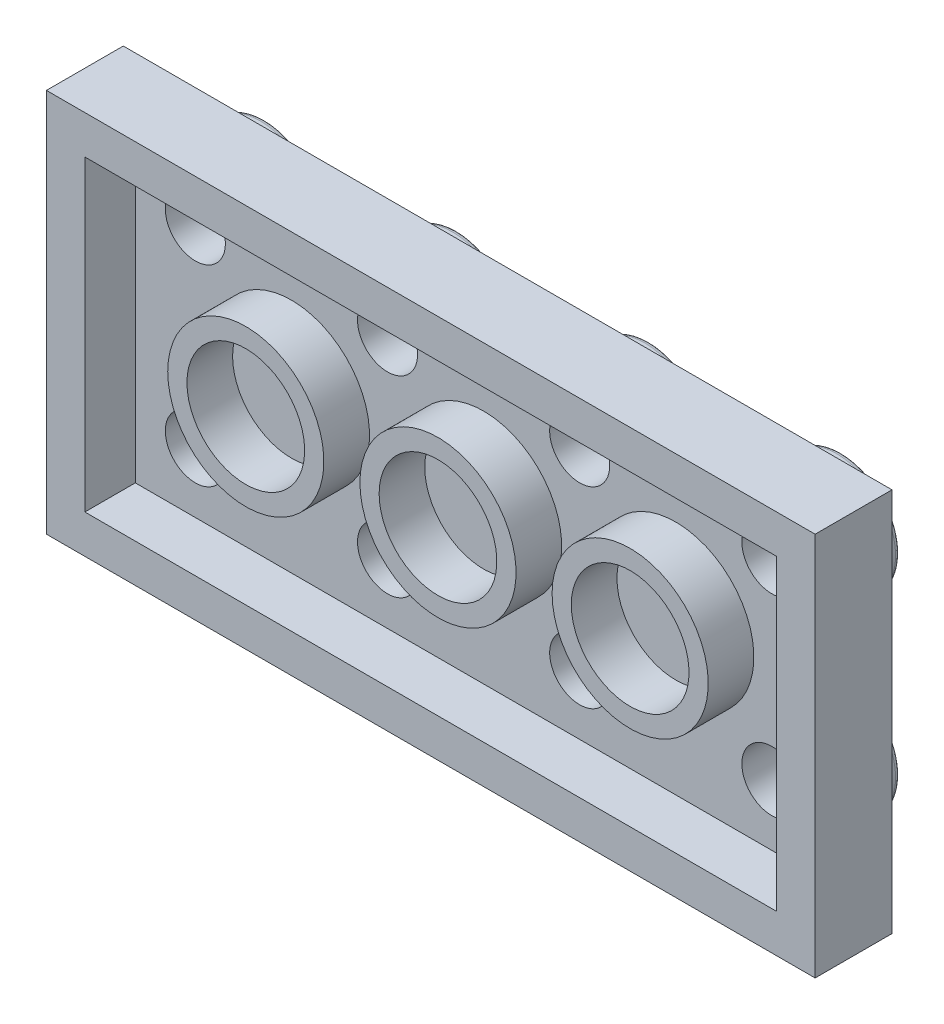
ISO-10303-21;
HEADER;
FILE_DESCRIPTION(('STEP AP214'),'2;1');
FILE_NAME('part.step','',(''),(''),'','','');
FILE_SCHEMA(('AUTOMOTIVE_DESIGN { 1 0 10303 214 1 1 1 1 }'));
ENDSEC;
DATA;
#1=APPLICATION_CONTEXT('core data for automotive mechanical design processes');
#2=APPLICATION_PROTOCOL_DEFINITION('international standard','automotive_design',2000,#1);
#3=PRODUCT_CONTEXT('',#1,'mechanical');
#4=PRODUCT('Part','Part','',(#3));
#5=PRODUCT_RELATED_PRODUCT_CATEGORY('part','',(#4));
#6=PRODUCT_DEFINITION_FORMATION('','',#4);
#7=PRODUCT_DEFINITION_CONTEXT('part definition',#1,'design');
#8=PRODUCT_DEFINITION('design','',#6,#7);
#9=PRODUCT_DEFINITION_SHAPE('','',#8);
#10=(LENGTH_UNIT() NAMED_UNIT(*) SI_UNIT(.MILLI.,.METRE.));
#11=(NAMED_UNIT(*) PLANE_ANGLE_UNIT() SI_UNIT($,.RADIAN.));
#12=(NAMED_UNIT(*) SI_UNIT($,.STERADIAN.) SOLID_ANGLE_UNIT());
#13=UNCERTAINTY_MEASURE_WITH_UNIT(LENGTH_MEASURE(1.E-05),#10,'distance_accuracy_value','');
#14=(GEOMETRIC_REPRESENTATION_CONTEXT(3) GLOBAL_UNCERTAINTY_ASSIGNED_CONTEXT((#13)) GLOBAL_UNIT_ASSIGNED_CONTEXT((#10,
#11,#12)) REPRESENTATION_CONTEXT('',''));
#15=CARTESIAN_POINT('',(0.,0.,0.));
#16=DIRECTION('',(0.,0.,1.));
#17=DIRECTION('',(1.,0.,0.));
#18=AXIS2_PLACEMENT_3D('',#15,#16,#17);
#19=CARTESIAN_POINT('',(-1.6,-14.4,1.1));
#20=DIRECTION('',(0.,0.,1.));
#21=DIRECTION('',(1.,0.,0.));
#22=AXIS2_PLACEMENT_3D('',#19,#20,#21);
#23=PLANE('',#22);
#24=CARTESIAN_POINT('',(-27.9,-11.9,1.1));
#25=DIRECTION('',(0.,0.,1.));
#26=DIRECTION('',(1.,0.,0.));
#27=AXIS2_PLACEMENT_3D('',#24,#25,#26);
#28=CIRCLE('',#27,1.25);
#29=CARTESIAN_POINT('',(-26.65,-11.9,1.1));
#30=VERTEX_POINT('',#29);
#31=EDGE_CURVE('E253',#30,#30,#28,.T.);
#32=ORIENTED_EDGE('',*,*,#31,.F.);
#33=EDGE_LOOP('',(#32));
#34=FACE_BOUND('',#33,.T.);
#35=CARTESIAN_POINT('',(-19.9,-11.9,1.1));
#36=DIRECTION('',(0.,0.,1.));
#37=DIRECTION('',(1.,0.,0.));
#38=AXIS2_PLACEMENT_3D('',#35,#36,#37);
#39=CIRCLE('',#38,1.25);
#40=CARTESIAN_POINT('',(-18.65,-11.9,1.1));
#41=VERTEX_POINT('',#40);
#42=EDGE_CURVE('E257',#41,#41,#39,.T.);
#43=ORIENTED_EDGE('',*,*,#42,.F.);
#44=EDGE_LOOP('',(#43));
#45=FACE_BOUND('',#44,.T.);
#46=CARTESIAN_POINT('',(-11.9,-11.9,1.1));
#47=DIRECTION('',(0.,0.,1.));
#48=DIRECTION('',(1.,0.,0.));
#49=AXIS2_PLACEMENT_3D('',#46,#47,#48);
#50=CIRCLE('',#49,1.25);
#51=CARTESIAN_POINT('',(-10.65,-11.9,1.1));
#52=VERTEX_POINT('',#51);
#53=EDGE_CURVE('E261',#52,#52,#50,.T.);
#54=ORIENTED_EDGE('',*,*,#53,.F.);
#55=EDGE_LOOP('',(#54));
#56=FACE_BOUND('',#55,.T.);
#57=CARTESIAN_POINT('',(-3.9,-11.9,1.1));
#58=DIRECTION('',(0.,0.,1.));
#59=DIRECTION('',(1.,0.,0.));
#60=AXIS2_PLACEMENT_3D('',#57,#58,#59);
#61=CIRCLE('',#60,1.25);
#62=CARTESIAN_POINT('',(-2.65,-11.9,1.1));
#63=VERTEX_POINT('',#62);
#64=EDGE_CURVE('E265',#63,#63,#61,.T.);
#65=ORIENTED_EDGE('',*,*,#64,.F.);
#66=EDGE_LOOP('',(#65));
#67=FACE_BOUND('',#66,.T.);
#68=CARTESIAN_POINT('',(-27.9,-3.9,1.1));
#69=DIRECTION('',(0.,0.,1.));
#70=DIRECTION('',(1.,0.,0.));
#71=AXIS2_PLACEMENT_3D('',#68,#69,#70);
#72=CIRCLE('',#71,1.25);
#73=CARTESIAN_POINT('',(-26.65,-3.9,1.1));
#74=VERTEX_POINT('',#73);
#75=EDGE_CURVE('E269',#74,#74,#72,.T.);
#76=ORIENTED_EDGE('',*,*,#75,.F.);
#77=EDGE_LOOP('',(#76));
#78=FACE_BOUND('',#77,.T.);
#79=CARTESIAN_POINT('',(-19.9,-3.9,1.1));
#80=DIRECTION('',(0.,0.,1.));
#81=DIRECTION('',(1.,0.,0.));
#82=AXIS2_PLACEMENT_3D('',#79,#80,#81);
#83=CIRCLE('',#82,1.25);
#84=CARTESIAN_POINT('',(-18.65,-3.9,1.1));
#85=VERTEX_POINT('',#84);
#86=EDGE_CURVE('E273',#85,#85,#83,.T.);
#87=ORIENTED_EDGE('',*,*,#86,.F.);
#88=EDGE_LOOP('',(#87));
#89=FACE_BOUND('',#88,.T.);
#90=CARTESIAN_POINT('',(-11.9,-3.9,1.1));
#91=DIRECTION('',(0.,0.,1.));
#92=DIRECTION('',(1.,0.,0.));
#93=AXIS2_PLACEMENT_3D('',#90,#91,#92);
#94=CIRCLE('',#93,1.25);
#95=CARTESIAN_POINT('',(-10.65,-3.9,1.1));
#96=VERTEX_POINT('',#95);
#97=EDGE_CURVE('E277',#96,#96,#94,.T.);
#98=ORIENTED_EDGE('',*,*,#97,.F.);
#99=EDGE_LOOP('',(#98));
#100=FACE_BOUND('',#99,.T.);
#101=CARTESIAN_POINT('',(-3.9,-3.9,1.1));
#102=DIRECTION('',(0.,0.,1.));
#103=DIRECTION('',(1.,0.,0.));
#104=AXIS2_PLACEMENT_3D('',#101,#102,#103);
#105=CIRCLE('',#104,1.25);
#106=CARTESIAN_POINT('',(-2.65,-3.9,1.1));
#107=VERTEX_POINT('',#106);
#108=EDGE_CURVE('E281',#107,#107,#105,.T.);
#109=ORIENTED_EDGE('',*,*,#108,.F.);
#110=EDGE_LOOP('',(#109));
#111=FACE_BOUND('',#110,.T.);
#112=DIRECTION('',(0.,1.,0.));
#113=VECTOR('',#112,1.);
#114=CARTESIAN_POINT('',(-1.6,-14.4,1.1));
#115=LINE('',#114,#113);
#116=CARTESIAN_POINT('',(-1.6,-14.4,1.1));
#117=VERTEX_POINT('',#116);
#118=CARTESIAN_POINT('',(-1.6,-1.6,1.1));
#119=VERTEX_POINT('',#118);
#120=EDGE_CURVE('E116',#117,#119,#115,.T.);
#121=ORIENTED_EDGE('',*,*,#120,.T.);
#122=DIRECTION('',(-1.,0.,0.));
#123=VECTOR('',#122,1.);
#124=CARTESIAN_POINT('',(-1.6,-1.6,1.1));
#125=LINE('',#124,#123);
#126=CARTESIAN_POINT('',(-30.4,-1.6,1.1));
#127=VERTEX_POINT('',#126);
#128=EDGE_CURVE('E122',#119,#127,#125,.T.);
#129=ORIENTED_EDGE('',*,*,#128,.T.);
#130=DIRECTION('',(0.,-1.,0.));
#131=VECTOR('',#130,1.);
#132=CARTESIAN_POINT('',(-30.4,-14.4,1.1));
#133=LINE('',#132,#131);
#134=CARTESIAN_POINT('',(-30.4,-14.4,1.1));
#135=VERTEX_POINT('',#134);
#136=EDGE_CURVE('E100',#127,#135,#133,.T.);
#137=ORIENTED_EDGE('',*,*,#136,.T.);
#138=DIRECTION('',(1.,0.,0.));
#139=VECTOR('',#138,1.);
#140=CARTESIAN_POINT('',(-1.6,-14.4,1.1));
#141=LINE('',#140,#139);
#142=EDGE_CURVE('E125',#135,#117,#141,.T.);
#143=ORIENTED_EDGE('',*,*,#142,.T.);
#144=EDGE_LOOP('',(#121,#129,#137,#143));
#145=FACE_BOUND('',#144,.T.);
#146=CARTESIAN_POINT('',(-7.9,-7.80984541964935,1.1));
#147=DIRECTION('',(0.,0.,1.));
#148=DIRECTION('',(1.,0.,0.));
#149=AXIS2_PLACEMENT_3D('',#146,#147,#148);
#150=CIRCLE('',#149,3.25);
#151=CARTESIAN_POINT('',(-11.15,-7.80984541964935,1.1));
#152=VERTEX_POINT('',#151);
#153=EDGE_CURVE('E287',#152,#152,#150,.T.);
#154=ORIENTED_EDGE('',*,*,#153,.F.);
#155=EDGE_LOOP('',(#154));
#156=FACE_BOUND('',#155,.T.);
#157=CARTESIAN_POINT('',(-15.9,-7.80984541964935,1.1));
#158=DIRECTION('',(0.,0.,1.));
#159=DIRECTION('',(1.,0.,0.));
#160=AXIS2_PLACEMENT_3D('',#157,#158,#159);
#161=CIRCLE('',#160,3.25);
#162=CARTESIAN_POINT('',(-19.15,-7.80984541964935,1.1));
#163=VERTEX_POINT('',#162);
#164=EDGE_CURVE('E291',#163,#163,#161,.T.);
#165=ORIENTED_EDGE('',*,*,#164,.F.);
#166=EDGE_LOOP('',(#165));
#167=FACE_BOUND('',#166,.T.);
#168=CARTESIAN_POINT('',(-23.9,-7.80984541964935,1.1));
#169=DIRECTION('',(0.,0.,1.));
#170=DIRECTION('',(1.,0.,0.));
#171=AXIS2_PLACEMENT_3D('',#168,#169,#170);
#172=CIRCLE('',#171,3.25);
#173=CARTESIAN_POINT('',(-27.15,-7.80984541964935,1.1));
#174=VERTEX_POINT('',#173);
#175=EDGE_CURVE('E294',#174,#174,#172,.T.);
#176=ORIENTED_EDGE('',*,*,#175,.F.);
#177=EDGE_LOOP('',(#176));
#178=FACE_BOUND('',#177,.T.);
#179=ADVANCED_FACE('F27',(#34,#45,#56,#67,#78,#89,#100,#111,#145,#156,#167,#178),#23,.T.);
#180=CARTESIAN_POINT('',(0.,0.,0.));
#181=DIRECTION('',(0.,0.,-1.));
#182=DIRECTION('',(-1.,0.,0.));
#183=AXIS2_PLACEMENT_3D('',#180,#181,#182);
#184=PLANE('',#183);
#185=CARTESIAN_POINT('',(-20.,-12.,0.));
#186=DIRECTION('',(0.,0.,-1.));
#187=DIRECTION('',(-1.,0.,0.));
#188=AXIS2_PLACEMENT_3D('',#185,#186,#187);
#189=CIRCLE('',#188,2.45);
#190=CARTESIAN_POINT('',(-17.55,-12.,0.));
#191=VERTEX_POINT('',#190);
#192=EDGE_CURVE('E342',#191,#191,#189,.T.);
#193=ORIENTED_EDGE('',*,*,#192,.F.);
#194=EDGE_LOOP('',(#193));
#195=FACE_BOUND('',#194,.T.);
#196=CARTESIAN_POINT('',(-4.,-12.,0.));
#197=DIRECTION('',(0.,0.,-1.));
#198=DIRECTION('',(-1.,0.,0.));
#199=AXIS2_PLACEMENT_3D('',#196,#197,#198);
#200=CIRCLE('',#199,2.45);
#201=CARTESIAN_POINT('',(-1.54999999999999,-12.,0.));
#202=VERTEX_POINT('',#201);
#203=EDGE_CURVE('E348',#202,#202,#200,.T.);
#204=ORIENTED_EDGE('',*,*,#203,.F.);
#205=EDGE_LOOP('',(#204));
#206=FACE_BOUND('',#205,.T.);
#207=CARTESIAN_POINT('',(-20.,-4.,0.));
#208=DIRECTION('',(0.,0.,-1.));
#209=DIRECTION('',(-1.,0.,0.));
#210=AXIS2_PLACEMENT_3D('',#207,#208,#209);
#211=CIRCLE('',#210,2.45);
#212=CARTESIAN_POINT('',(-17.55,-4.,0.));
#213=VERTEX_POINT('',#212);
#214=EDGE_CURVE('E354',#213,#213,#211,.T.);
#215=ORIENTED_EDGE('',*,*,#214,.F.);
#216=EDGE_LOOP('',(#215));
#217=FACE_BOUND('',#216,.T.);
#218=CARTESIAN_POINT('',(-4.,-4.,0.));
#219=DIRECTION('',(0.,0.,-1.));
#220=DIRECTION('',(-1.,0.,0.));
#221=AXIS2_PLACEMENT_3D('',#218,#219,#220);
#222=CIRCLE('',#221,2.45);
#223=CARTESIAN_POINT('',(-1.55,-4.,0.));
#224=VERTEX_POINT('',#223);
#225=EDGE_CURVE('E364',#224,#224,#222,.T.);
#226=ORIENTED_EDGE('',*,*,#225,.F.);
#227=EDGE_LOOP('',(#226));
#228=FACE_BOUND('',#227,.T.);
#229=DIRECTION('',(0.,1.,0.));
#230=VECTOR('',#229,1.);
#231=CARTESIAN_POINT('',(0.,0.,0.));
#232=LINE('',#231,#230);
#233=CARTESIAN_POINT('',(0.,-16.,0.));
#234=VERTEX_POINT('',#233);
#235=CARTESIAN_POINT('',(0.,0.,0.));
#236=VERTEX_POINT('',#235);
#237=EDGE_CURVE('E130',#234,#236,#232,.T.);
#238=ORIENTED_EDGE('',*,*,#237,.F.);
#239=DIRECTION('',(1.,0.,0.));
#240=VECTOR('',#239,1.);
#241=CARTESIAN_POINT('',(0.,-16.,0.));
#242=LINE('',#241,#240);
#243=CARTESIAN_POINT('',(-32.,-16.,0.));
#244=VERTEX_POINT('',#243);
#245=EDGE_CURVE('E139',#244,#234,#242,.T.);
#246=ORIENTED_EDGE('',*,*,#245,.F.);
#247=DIRECTION('',(0.,-1.,0.));
#248=VECTOR('',#247,1.);
#249=CARTESIAN_POINT('',(-32.,0.,0.));
#250=LINE('',#249,#248);
#251=CARTESIAN_POINT('',(-32.,0.,0.));
#252=VERTEX_POINT('',#251);
#253=EDGE_CURVE('E137',#252,#244,#250,.T.);
#254=ORIENTED_EDGE('',*,*,#253,.F.);
#255=DIRECTION('',(-1.,0.,0.));
#256=VECTOR('',#255,1.);
#257=CARTESIAN_POINT('',(0.,0.,0.));
#258=LINE('',#257,#256);
#259=EDGE_CURVE('E135',#236,#252,#258,.T.);
#260=ORIENTED_EDGE('',*,*,#259,.F.);
#261=EDGE_LOOP('',(#238,#246,#254,#260));
#262=FACE_BOUND('',#261,.T.);
#263=CARTESIAN_POINT('',(-12.,-4.,0.));
#264=DIRECTION('',(0.,0.,-1.));
#265=DIRECTION('',(-1.,0.,0.));
#266=AXIS2_PLACEMENT_3D('',#263,#264,#265);
#267=CIRCLE('',#266,2.45);
#268=CARTESIAN_POINT('',(-9.55,-4.,0.));
#269=VERTEX_POINT('',#268);
#270=EDGE_CURVE('E357',#269,#269,#267,.T.);
#271=ORIENTED_EDGE('',*,*,#270,.F.);
#272=EDGE_LOOP('',(#271));
#273=FACE_BOUND('',#272,.T.);
#274=CARTESIAN_POINT('',(-28.,-4.,0.));
#275=DIRECTION('',(0.,0.,-1.));
#276=DIRECTION('',(-1.,0.,0.));
#277=AXIS2_PLACEMENT_3D('',#274,#275,#276);
#278=CIRCLE('',#277,2.45);
#279=CARTESIAN_POINT('',(-25.55,-4.,0.));
#280=VERTEX_POINT('',#279);
#281=EDGE_CURVE('E351',#280,#280,#278,.T.);
#282=ORIENTED_EDGE('',*,*,#281,.F.);
#283=EDGE_LOOP('',(#282));
#284=FACE_BOUND('',#283,.T.);
#285=CARTESIAN_POINT('',(-12.,-12.,0.));
#286=DIRECTION('',(0.,0.,-1.));
#287=DIRECTION('',(-1.,0.,0.));
#288=AXIS2_PLACEMENT_3D('',#285,#286,#287);
#289=CIRCLE('',#288,2.45);
#290=CARTESIAN_POINT('',(-9.54999999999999,-12.,0.));
#291=VERTEX_POINT('',#290);
#292=EDGE_CURVE('E345',#291,#291,#289,.T.);
#293=ORIENTED_EDGE('',*,*,#292,.F.);
#294=EDGE_LOOP('',(#293));
#295=FACE_BOUND('',#294,.T.);
#296=CARTESIAN_POINT('',(-28.,-12.,0.));
#297=DIRECTION('',(0.,0.,-1.));
#298=DIRECTION('',(-1.,0.,0.));
#299=AXIS2_PLACEMENT_3D('',#296,#297,#298);
#300=CIRCLE('',#299,2.45);
#301=CARTESIAN_POINT('',(-25.55,-12.,0.));
#302=VERTEX_POINT('',#301);
#303=EDGE_CURVE('E339',#302,#302,#300,.T.);
#304=ORIENTED_EDGE('',*,*,#303,.F.);
#305=EDGE_LOOP('',(#304));
#306=FACE_BOUND('',#305,.T.);
#307=ADVANCED_FACE('F241',(#195,#206,#217,#228,#262,#273,#284,#295,#306),#184,.T.);
#308=CARTESIAN_POINT('',(0.,0.,3.2));
#309=DIRECTION('',(-1.,0.,0.));
#310=DIRECTION('',(0.,-1.,0.));
#311=AXIS2_PLACEMENT_3D('',#308,#309,#310);
#312=PLANE('',#311);
#313=ORIENTED_EDGE('',*,*,#237,.T.);
#314=DIRECTION('',(0.,0.,-1.));
#315=VECTOR('',#314,1.);
#316=CARTESIAN_POINT('',(0.,0.,3.2));
#317=LINE('',#316,#315);
#318=CARTESIAN_POINT('',(0.,0.,3.2));
#319=VERTEX_POINT('',#318);
#320=EDGE_CURVE('E157',#319,#236,#317,.T.);
#321=ORIENTED_EDGE('',*,*,#320,.F.);
#322=DIRECTION('',(0.,1.,0.));
#323=VECTOR('',#322,1.);
#324=CARTESIAN_POINT('',(0.,0.,3.2));
#325=LINE('',#324,#323);
#326=CARTESIAN_POINT('',(0.,-16.,3.2));
#327=VERTEX_POINT('',#326);
#328=EDGE_CURVE('E141',#327,#319,#325,.T.);
#329=ORIENTED_EDGE('',*,*,#328,.F.);
#330=DIRECTION('',(0.,0.,-1.));
#331=VECTOR('',#330,1.);
#332=CARTESIAN_POINT('',(0.,-16.,3.2));
#333=LINE('',#332,#331);
#334=EDGE_CURVE('E148',#327,#234,#333,.T.);
#335=ORIENTED_EDGE('',*,*,#334,.T.);
#336=EDGE_LOOP('',(#313,#321,#329,#335));
#337=FACE_BOUND('',#336,.T.);
#338=ADVANCED_FACE('F29',(#337),#312,.F.);
#339=CARTESIAN_POINT('',(0.,0.,3.2));
#340=DIRECTION('',(0.,-1.,0.));
#341=DIRECTION('',(1.,0.,0.));
#342=AXIS2_PLACEMENT_3D('',#339,#340,#341);
#343=PLANE('',#342);
#344=ORIENTED_EDGE('',*,*,#259,.T.);
#345=DIRECTION('',(0.,0.,-1.));
#346=VECTOR('',#345,1.);
#347=CARTESIAN_POINT('',(-32.,0.,3.2));
#348=LINE('',#347,#346);
#349=CARTESIAN_POINT('',(-32.,0.,3.2));
#350=VERTEX_POINT('',#349);
#351=EDGE_CURVE('E154',#350,#252,#348,.T.);
#352=ORIENTED_EDGE('',*,*,#351,.F.);
#353=DIRECTION('',(-1.,0.,0.));
#354=VECTOR('',#353,1.);
#355=CARTESIAN_POINT('',(0.,0.,3.2));
#356=LINE('',#355,#354);
#357=EDGE_CURVE('E143',#319,#350,#356,.T.);
#358=ORIENTED_EDGE('',*,*,#357,.F.);
#359=ORIENTED_EDGE('',*,*,#320,.T.);
#360=EDGE_LOOP('',(#344,#352,#358,#359));
#361=FACE_BOUND('',#360,.T.);
#362=ADVANCED_FACE('F818',(#361),#343,.F.);
#363=CARTESIAN_POINT('',(-32.,0.,3.2));
#364=DIRECTION('',(1.,0.,0.));
#365=DIRECTION('',(0.,0.,-1.));
#366=AXIS2_PLACEMENT_3D('',#363,#364,#365);
#367=PLANE('',#366);
#368=ORIENTED_EDGE('',*,*,#253,.T.);
#369=DIRECTION('',(0.,0.,-1.));
#370=VECTOR('',#369,1.);
#371=CARTESIAN_POINT('',(-32.,-16.,3.2));
#372=LINE('',#371,#370);
#373=CARTESIAN_POINT('',(-32.,-16.,3.2));
#374=VERTEX_POINT('',#373);
#375=EDGE_CURVE('E151',#374,#244,#372,.T.);
#376=ORIENTED_EDGE('',*,*,#375,.F.);
#377=DIRECTION('',(0.,-1.,0.));
#378=VECTOR('',#377,1.);
#379=CARTESIAN_POINT('',(-32.,0.,3.2));
#380=LINE('',#379,#378);
#381=EDGE_CURVE('E145',#350,#374,#380,.T.);
#382=ORIENTED_EDGE('',*,*,#381,.F.);
#383=ORIENTED_EDGE('',*,*,#351,.T.);
#384=EDGE_LOOP('',(#368,#376,#382,#383));
#385=FACE_BOUND('',#384,.T.);
#386=ADVANCED_FACE('F810',(#385),#367,.F.);
#387=CARTESIAN_POINT('',(0.,-16.,3.2));
#388=DIRECTION('',(0.,1.,0.));
#389=DIRECTION('',(-1.,0.,0.));
#390=AXIS2_PLACEMENT_3D('',#387,#388,#389);
#391=PLANE('',#390);
#392=ORIENTED_EDGE('',*,*,#245,.T.);
#393=ORIENTED_EDGE('',*,*,#334,.F.);
#394=DIRECTION('',(1.,0.,0.));
#395=VECTOR('',#394,1.);
#396=CARTESIAN_POINT('',(0.,-16.,3.2));
#397=LINE('',#396,#395);
#398=EDGE_CURVE('E50',#374,#327,#397,.T.);
#399=ORIENTED_EDGE('',*,*,#398,.F.);
#400=ORIENTED_EDGE('',*,*,#375,.T.);
#401=EDGE_LOOP('',(#392,#393,#399,#400));
#402=FACE_BOUND('',#401,.T.);
#403=ADVANCED_FACE('F803',(#402),#391,.F.);
#404=CARTESIAN_POINT('',(0.,0.,3.2));
#405=DIRECTION('',(0.,0.,-1.));
#406=DIRECTION('',(-1.,0.,0.));
#407=AXIS2_PLACEMENT_3D('',#404,#405,#406);
#408=PLANE('',#407);
#409=DIRECTION('',(-1.,0.,0.));
#410=VECTOR('',#409,1.);
#411=CARTESIAN_POINT('',(-1.6,-1.6,3.2));
#412=LINE('',#411,#410);
#413=CARTESIAN_POINT('',(-1.6,-1.6,3.2));
#414=VERTEX_POINT('',#413);
#415=CARTESIAN_POINT('',(-30.4,-1.6,3.2));
#416=VERTEX_POINT('',#415);
#417=EDGE_CURVE('E108',#414,#416,#412,.T.);
#418=ORIENTED_EDGE('',*,*,#417,.F.);
#419=DIRECTION('',(0.,1.,0.));
#420=VECTOR('',#419,1.);
#421=CARTESIAN_POINT('',(-1.6,-14.4,3.2));
#422=LINE('',#421,#420);
#423=CARTESIAN_POINT('',(-1.6,-14.4,3.2));
#424=VERTEX_POINT('',#423);
#425=EDGE_CURVE('E42',#424,#414,#422,.T.);
#426=ORIENTED_EDGE('',*,*,#425,.F.);
#427=DIRECTION('',(1.,0.,0.));
#428=VECTOR('',#427,1.);
#429=CARTESIAN_POINT('',(-1.6,-14.4,3.2));
#430=LINE('',#429,#428);
#431=CARTESIAN_POINT('',(-30.4,-14.4,3.2));
#432=VERTEX_POINT('',#431);
#433=EDGE_CURVE('E114',#432,#424,#430,.T.);
#434=ORIENTED_EDGE('',*,*,#433,.F.);
#435=DIRECTION('',(0.,-1.,0.));
#436=VECTOR('',#435,1.);
#437=CARTESIAN_POINT('',(-30.4,-14.4,3.2));
#438=LINE('',#437,#436);
#439=EDGE_CURVE('E97',#416,#432,#438,.T.);
#440=ORIENTED_EDGE('',*,*,#439,.F.);
#441=EDGE_LOOP('',(#418,#426,#434,#440));
#442=FACE_BOUND('',#441,.T.);
#443=ORIENTED_EDGE('',*,*,#328,.T.);
#444=ORIENTED_EDGE('',*,*,#357,.T.);
#445=ORIENTED_EDGE('',*,*,#381,.T.);
#446=ORIENTED_EDGE('',*,*,#398,.T.);
#447=EDGE_LOOP('',(#443,#444,#445,#446));
#448=FACE_BOUND('',#447,.T.);
#449=ADVANCED_FACE('F112',(#442,#448),#408,.F.);
#450=CARTESIAN_POINT('',(-1.6,-14.4,1.1));
#451=DIRECTION('',(1.,0.,0.));
#452=DIRECTION('',(0.,0.,-1.));
#453=AXIS2_PLACEMENT_3D('',#450,#451,#452);
#454=PLANE('',#453);
#455=ORIENTED_EDGE('',*,*,#425,.T.);
#456=DIRECTION('',(0.,0.,1.));
#457=VECTOR('',#456,1.);
#458=CARTESIAN_POINT('',(-1.6,-1.6,1.1));
#459=LINE('',#458,#457);
#460=EDGE_CURVE('E105',#119,#414,#459,.T.);
#461=ORIENTED_EDGE('',*,*,#460,.F.);
#462=ORIENTED_EDGE('',*,*,#120,.F.);
#463=DIRECTION('',(0.,0.,1.));
#464=VECTOR('',#463,1.);
#465=CARTESIAN_POINT('',(-1.6,-14.4,1.1));
#466=LINE('',#465,#464);
#467=EDGE_CURVE('E128',#117,#424,#466,.T.);
#468=ORIENTED_EDGE('',*,*,#467,.T.);
#469=EDGE_LOOP('',(#455,#461,#462,#468));
#470=FACE_BOUND('',#469,.T.);
#471=ADVANCED_FACE('F790',(#470),#454,.F.);
#472=CARTESIAN_POINT('',(-1.6,-14.4,1.1));
#473=DIRECTION('',(0.,-1.,0.));
#474=DIRECTION('',(1.,0.,0.));
#475=AXIS2_PLACEMENT_3D('',#472,#473,#474);
#476=PLANE('',#475);
#477=ORIENTED_EDGE('',*,*,#433,.T.);
#478=ORIENTED_EDGE('',*,*,#467,.F.);
#479=ORIENTED_EDGE('',*,*,#142,.F.);
#480=DIRECTION('',(0.,0.,1.));
#481=VECTOR('',#480,1.);
#482=CARTESIAN_POINT('',(-30.4,-14.4,1.1));
#483=LINE('',#482,#481);
#484=EDGE_CURVE('E104',#135,#432,#483,.T.);
#485=ORIENTED_EDGE('',*,*,#484,.T.);
#486=EDGE_LOOP('',(#477,#478,#479,#485));
#487=FACE_BOUND('',#486,.T.);
#488=ADVANCED_FACE('F783',(#487),#476,.F.);
#489=CARTESIAN_POINT('',(-30.4,-14.4,1.1));
#490=DIRECTION('',(-1.,0.,0.));
#491=DIRECTION('',(0.,0.,1.));
#492=AXIS2_PLACEMENT_3D('',#489,#490,#491);
#493=PLANE('',#492);
#494=ORIENTED_EDGE('',*,*,#439,.T.);
#495=ORIENTED_EDGE('',*,*,#484,.F.);
#496=ORIENTED_EDGE('',*,*,#136,.F.);
#497=DIRECTION('',(0.,0.,1.));
#498=VECTOR('',#497,1.);
#499=CARTESIAN_POINT('',(-30.4,-1.6,1.1));
#500=LINE('',#499,#498);
#501=EDGE_CURVE('E93',#127,#416,#500,.T.);
#502=ORIENTED_EDGE('',*,*,#501,.T.);
#503=EDGE_LOOP('',(#494,#495,#496,#502));
#504=FACE_BOUND('',#503,.T.);
#505=ADVANCED_FACE('F95',(#504),#493,.F.);
#506=CARTESIAN_POINT('',(-1.6,-1.6,1.1));
#507=DIRECTION('',(0.,1.,0.));
#508=DIRECTION('',(-1.,0.,0.));
#509=AXIS2_PLACEMENT_3D('',#506,#507,#508);
#510=PLANE('',#509);
#511=ORIENTED_EDGE('',*,*,#417,.T.);
#512=ORIENTED_EDGE('',*,*,#501,.F.);
#513=ORIENTED_EDGE('',*,*,#128,.F.);
#514=ORIENTED_EDGE('',*,*,#460,.T.);
#515=EDGE_LOOP('',(#511,#512,#513,#514));
#516=FACE_BOUND('',#515,.T.);
#517=ADVANCED_FACE('F109',(#516),#510,.F.);
#518=CARTESIAN_POINT('',(-7.9,-7.80984541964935,3.));
#519=DIRECTION('',(0.,0.,1.));
#520=DIRECTION('',(1.,0.,0.));
#521=AXIS2_PLACEMENT_3D('',#518,#519,#520);
#522=PLANE('',#521);
#523=CARTESIAN_POINT('',(-7.9,-7.80984541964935,3.));
#524=DIRECTION('',(0.,0.,1.));
#525=DIRECTION('',(1.,0.,0.));
#526=AXIS2_PLACEMENT_3D('',#523,#524,#525);
#527=CIRCLE('',#526,3.25);
#528=CARTESIAN_POINT('',(-11.15,-7.80984541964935,3.));
#529=VERTEX_POINT('',#528);
#530=EDGE_CURVE('E371',#529,#529,#527,.T.);
#531=ORIENTED_EDGE('',*,*,#530,.T.);
#532=EDGE_LOOP('',(#531));
#533=FACE_BOUND('',#532,.T.);
#534=CARTESIAN_POINT('',(-7.9,-7.80984541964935,3.));
#535=DIRECTION('',(0.,0.,1.));
#536=DIRECTION('',(1.,0.,0.));
#537=AXIS2_PLACEMENT_3D('',#534,#535,#536);
#538=CIRCLE('',#537,2.45);
#539=CARTESIAN_POINT('',(-10.35,-7.80984541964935,3.));
#540=VERTEX_POINT('',#539);
#541=EDGE_CURVE('E367',#540,#540,#538,.T.);
#542=ORIENTED_EDGE('',*,*,#541,.F.);
#543=EDGE_LOOP('',(#542));
#544=FACE_BOUND('',#543,.T.);
#545=ADVANCED_FACE('F375',(#533,#544),#522,.T.);
#546=CARTESIAN_POINT('',(-7.9,-7.80984541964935,3.));
#547=DIRECTION('',(0.,0.,-1.));
#548=DIRECTION('',(-1.,0.,0.));
#549=AXIS2_PLACEMENT_3D('',#546,#547,#548);
#550=CYLINDRICAL_SURFACE('',#549,3.25);
#551=CARTESIAN_POINT('',(-11.15,-7.80984541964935,3.));
#552=CARTESIAN_POINT('',(-11.15,-7.80984541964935,2.98020833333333));
#553=CARTESIAN_POINT('',(-11.15,-7.80984541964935,2.96041666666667));
#554=CARTESIAN_POINT('',(-11.15,-7.80984541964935,2.92083333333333));
#555=CARTESIAN_POINT('',(-11.15,-7.80984541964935,2.90104166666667));
#556=CARTESIAN_POINT('',(-11.15,-7.80984541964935,2.86145833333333));
#557=CARTESIAN_POINT('',(-11.15,-7.80984541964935,2.84166666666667));
#558=CARTESIAN_POINT('',(-11.15,-7.80984541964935,2.80208333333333));
#559=CARTESIAN_POINT('',(-11.15,-7.80984541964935,2.78229166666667));
#560=CARTESIAN_POINT('',(-11.15,-7.80984541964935,2.74270833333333));
#561=CARTESIAN_POINT('',(-11.15,-7.80984541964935,2.72291666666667));
#562=CARTESIAN_POINT('',(-11.15,-7.80984541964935,2.68333333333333));
#563=CARTESIAN_POINT('',(-11.15,-7.80984541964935,2.66354166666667));
#564=CARTESIAN_POINT('',(-11.15,-7.80984541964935,2.62395833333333));
#565=CARTESIAN_POINT('',(-11.15,-7.80984541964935,2.60416666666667));
#566=CARTESIAN_POINT('',(-11.15,-7.80984541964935,2.56458333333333));
#567=CARTESIAN_POINT('',(-11.15,-7.80984541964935,2.54479166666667));
#568=CARTESIAN_POINT('',(-11.15,-7.80984541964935,2.50520833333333));
#569=CARTESIAN_POINT('',(-11.15,-7.80984541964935,2.48541666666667));
#570=CARTESIAN_POINT('',(-11.15,-7.80984541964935,2.44583333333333));
#571=CARTESIAN_POINT('',(-11.15,-7.80984541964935,2.42604166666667));
#572=CARTESIAN_POINT('',(-11.15,-7.80984541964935,2.38645833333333));
#573=CARTESIAN_POINT('',(-11.15,-7.80984541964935,2.36666666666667));
#574=CARTESIAN_POINT('',(-11.15,-7.80984541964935,2.32708333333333));
#575=CARTESIAN_POINT('',(-11.15,-7.80984541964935,2.30729166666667));
#576=CARTESIAN_POINT('',(-11.15,-7.80984541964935,2.26770833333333));
#577=CARTESIAN_POINT('',(-11.15,-7.80984541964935,2.24791666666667));
#578=CARTESIAN_POINT('',(-11.15,-7.80984541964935,2.20833333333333));
#579=CARTESIAN_POINT('',(-11.15,-7.80984541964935,2.18854166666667));
#580=CARTESIAN_POINT('',(-11.15,-7.80984541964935,2.14895833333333));
#581=CARTESIAN_POINT('',(-11.15,-7.80984541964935,2.12916666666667));
#582=CARTESIAN_POINT('',(-11.15,-7.80984541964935,2.08958333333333));
#583=CARTESIAN_POINT('',(-11.15,-7.80984541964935,2.06979166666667));
#584=CARTESIAN_POINT('',(-11.15,-7.80984541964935,2.03020833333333));
#585=CARTESIAN_POINT('',(-11.15,-7.80984541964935,2.01041666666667));
#586=CARTESIAN_POINT('',(-11.15,-7.80984541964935,1.97083333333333));
#587=CARTESIAN_POINT('',(-11.15,-7.80984541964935,1.95104166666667));
#588=CARTESIAN_POINT('',(-11.15,-7.80984541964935,1.91145833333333));
#589=CARTESIAN_POINT('',(-11.15,-7.80984541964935,1.89166666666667));
#590=CARTESIAN_POINT('',(-11.15,-7.80984541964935,1.85208333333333));
#591=CARTESIAN_POINT('',(-11.15,-7.80984541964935,1.83229166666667));
#592=CARTESIAN_POINT('',(-11.15,-7.80984541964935,1.79270833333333));
#593=CARTESIAN_POINT('',(-11.15,-7.80984541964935,1.77291666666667));
#594=CARTESIAN_POINT('',(-11.15,-7.80984541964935,1.73333333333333));
#595=CARTESIAN_POINT('',(-11.15,-7.80984541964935,1.71354166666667));
#596=CARTESIAN_POINT('',(-11.15,-7.80984541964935,1.67395833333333));
#597=CARTESIAN_POINT('',(-11.15,-7.80984541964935,1.65416666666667));
#598=CARTESIAN_POINT('',(-11.15,-7.80984541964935,1.61458333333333));
#599=CARTESIAN_POINT('',(-11.15,-7.80984541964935,1.59479166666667));
#600=CARTESIAN_POINT('',(-11.15,-7.80984541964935,1.55520833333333));
#601=CARTESIAN_POINT('',(-11.15,-7.80984541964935,1.53541666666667));
#602=CARTESIAN_POINT('',(-11.15,-7.80984541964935,1.49583333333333));
#603=CARTESIAN_POINT('',(-11.15,-7.80984541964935,1.47604166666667));
#604=CARTESIAN_POINT('',(-11.15,-7.80984541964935,1.43645833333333));
#605=CARTESIAN_POINT('',(-11.15,-7.80984541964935,1.41666666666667));
#606=CARTESIAN_POINT('',(-11.15,-7.80984541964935,1.37708333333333));
#607=CARTESIAN_POINT('',(-11.15,-7.80984541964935,1.35729166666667));
#608=CARTESIAN_POINT('',(-11.15,-7.80984541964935,1.31770833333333));
#609=CARTESIAN_POINT('',(-11.15,-7.80984541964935,1.29791666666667));
#610=CARTESIAN_POINT('',(-11.15,-7.80984541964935,1.25833333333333));
#611=CARTESIAN_POINT('',(-11.15,-7.80984541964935,1.23854166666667));
#612=CARTESIAN_POINT('',(-11.15,-7.80984541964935,1.19895833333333));
#613=CARTESIAN_POINT('',(-11.15,-7.80984541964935,1.17916666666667));
#614=CARTESIAN_POINT('',(-11.15,-7.80984541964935,1.13958333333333));
#615=CARTESIAN_POINT('',(-11.15,-7.80984541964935,1.11979166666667));
#616=CARTESIAN_POINT('',(-11.15,-7.80984541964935,1.1));
#617=B_SPLINE_CURVE_WITH_KNOTS('',3,(#551,#552,#553,#554,#555,#556,#557,#558,#559,#560,#561,
#562,#563,#564,#565,#566,#567,#568,#569,#570,#571,#572,#573,#574,#575,#576,#577,#578,#579,#580,
#581,#582,#583,#584,#585,#586,#587,#588,#589,#590,#591,#592,#593,#594,#595,#596,#597,#598,#599,
#600,#601,#602,#603,#604,#605,#606,#607,#608,#609,#610,#611,#612,#613,#614,#615,#616),
.UNSPECIFIED.,.F.,.F.,(4,2,2,2,2,2,2,2,2,2,2,2,2,2,2,2,2,2,2,2,2,2,2,2,2,2,2,2,2,2,2,2,4),(0.,
0.059375,0.11875,0.178125,0.2375,0.296875,0.35625,0.415625,0.475,0.534375,0.59375,0.653125,
0.7125,0.771875,0.83125,0.890625,0.95,1.009375,1.06875,1.128125,1.1875,1.246875,1.30625,
1.365625,1.425,1.484375,1.54375,1.603125,1.6625,1.721875,1.78125,1.840625,1.9),.UNSPECIFIED.);
#618=EDGE_CURVE('BSEAM378',#529,#152,#617,.T.);
#619=ORIENTED_EDGE('',*,*,#530,.F.);
#620=ORIENTED_EDGE('',*,*,#153,.T.);
#621=ORIENTED_EDGE('',*,*,#618,.T.);
#622=ORIENTED_EDGE('',*,*,#618,.F.);
#623=EDGE_LOOP('',(#619,#621,#620,#622));
#624=FACE_BOUND('',#623,.T.);
#625=ADVANCED_FACE('F378',(#624),#550,.T.);
#626=CARTESIAN_POINT('',(-7.9,-7.80984541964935,3.));
#627=DIRECTION('',(0.,0.,-1.));
#628=DIRECTION('',(-1.,0.,0.));
#629=AXIS2_PLACEMENT_3D('',#626,#627,#628);
#630=CYLINDRICAL_SURFACE('',#629,2.45);
#631=CARTESIAN_POINT('',(-7.9,-7.80984541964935,1.1));
#632=DIRECTION('',(0.,0.,1.));
#633=DIRECTION('',(1.,0.,0.));
#634=AXIS2_PLACEMENT_3D('',#631,#632,#633);
#635=CIRCLE('',#634,2.45);
#636=CARTESIAN_POINT('',(-10.35,-7.80984541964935,1.1));
#637=VERTEX_POINT('',#636);
#638=EDGE_CURVE('E160',#637,#637,#635,.F.);
#639=CARTESIAN_POINT('',(-10.35,-7.80984541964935,3.));
#640=CARTESIAN_POINT('',(-10.35,-7.80984541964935,2.98020833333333));
#641=CARTESIAN_POINT('',(-10.35,-7.80984541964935,2.96041666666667));
#642=CARTESIAN_POINT('',(-10.35,-7.80984541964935,2.92083333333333));
#643=CARTESIAN_POINT('',(-10.35,-7.80984541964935,2.90104166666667));
#644=CARTESIAN_POINT('',(-10.35,-7.80984541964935,2.86145833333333));
#645=CARTESIAN_POINT('',(-10.35,-7.80984541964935,2.84166666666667));
#646=CARTESIAN_POINT('',(-10.35,-7.80984541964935,2.80208333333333));
#647=CARTESIAN_POINT('',(-10.35,-7.80984541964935,2.78229166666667));
#648=CARTESIAN_POINT('',(-10.35,-7.80984541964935,2.74270833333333));
#649=CARTESIAN_POINT('',(-10.35,-7.80984541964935,2.72291666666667));
#650=CARTESIAN_POINT('',(-10.35,-7.80984541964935,2.68333333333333));
#651=CARTESIAN_POINT('',(-10.35,-7.80984541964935,2.66354166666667));
#652=CARTESIAN_POINT('',(-10.35,-7.80984541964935,2.62395833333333));
#653=CARTESIAN_POINT('',(-10.35,-7.80984541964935,2.60416666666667));
#654=CARTESIAN_POINT('',(-10.35,-7.80984541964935,2.56458333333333));
#655=CARTESIAN_POINT('',(-10.35,-7.80984541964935,2.54479166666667));
#656=CARTESIAN_POINT('',(-10.35,-7.80984541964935,2.50520833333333));
#657=CARTESIAN_POINT('',(-10.35,-7.80984541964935,2.48541666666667));
#658=CARTESIAN_POINT('',(-10.35,-7.80984541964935,2.44583333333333));
#659=CARTESIAN_POINT('',(-10.35,-7.80984541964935,2.42604166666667));
#660=CARTESIAN_POINT('',(-10.35,-7.80984541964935,2.38645833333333));
#661=CARTESIAN_POINT('',(-10.35,-7.80984541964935,2.36666666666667));
#662=CARTESIAN_POINT('',(-10.35,-7.80984541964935,2.32708333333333));
#663=CARTESIAN_POINT('',(-10.35,-7.80984541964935,2.30729166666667));
#664=CARTESIAN_POINT('',(-10.35,-7.80984541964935,2.26770833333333));
#665=CARTESIAN_POINT('',(-10.35,-7.80984541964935,2.24791666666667));
#666=CARTESIAN_POINT('',(-10.35,-7.80984541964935,2.20833333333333));
#667=CARTESIAN_POINT('',(-10.35,-7.80984541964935,2.18854166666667));
#668=CARTESIAN_POINT('',(-10.35,-7.80984541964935,2.14895833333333));
#669=CARTESIAN_POINT('',(-10.35,-7.80984541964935,2.12916666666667));
#670=CARTESIAN_POINT('',(-10.35,-7.80984541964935,2.08958333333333));
#671=CARTESIAN_POINT('',(-10.35,-7.80984541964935,2.06979166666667));
#672=CARTESIAN_POINT('',(-10.35,-7.80984541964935,2.03020833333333));
#673=CARTESIAN_POINT('',(-10.35,-7.80984541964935,2.01041666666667));
#674=CARTESIAN_POINT('',(-10.35,-7.80984541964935,1.97083333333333));
#675=CARTESIAN_POINT('',(-10.35,-7.80984541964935,1.95104166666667));
#676=CARTESIAN_POINT('',(-10.35,-7.80984541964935,1.91145833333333));
#677=CARTESIAN_POINT('',(-10.35,-7.80984541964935,1.89166666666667));
#678=CARTESIAN_POINT('',(-10.35,-7.80984541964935,1.85208333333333));
#679=CARTESIAN_POINT('',(-10.35,-7.80984541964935,1.83229166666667));
#680=CARTESIAN_POINT('',(-10.35,-7.80984541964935,1.79270833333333));
#681=CARTESIAN_POINT('',(-10.35,-7.80984541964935,1.77291666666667));
#682=CARTESIAN_POINT('',(-10.35,-7.80984541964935,1.73333333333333));
#683=CARTESIAN_POINT('',(-10.35,-7.80984541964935,1.71354166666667));
#684=CARTESIAN_POINT('',(-10.35,-7.80984541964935,1.67395833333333));
#685=CARTESIAN_POINT('',(-10.35,-7.80984541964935,1.65416666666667));
#686=CARTESIAN_POINT('',(-10.35,-7.80984541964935,1.61458333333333));
#687=CARTESIAN_POINT('',(-10.35,-7.80984541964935,1.59479166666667));
#688=CARTESIAN_POINT('',(-10.35,-7.80984541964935,1.55520833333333));
#689=CARTESIAN_POINT('',(-10.35,-7.80984541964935,1.53541666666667));
#690=CARTESIAN_POINT('',(-10.35,-7.80984541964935,1.49583333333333));
#691=CARTESIAN_POINT('',(-10.35,-7.80984541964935,1.47604166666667));
#692=CARTESIAN_POINT('',(-10.35,-7.80984541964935,1.43645833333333));
#693=CARTESIAN_POINT('',(-10.35,-7.80984541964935,1.41666666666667));
#694=CARTESIAN_POINT('',(-10.35,-7.80984541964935,1.37708333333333));
#695=CARTESIAN_POINT('',(-10.35,-7.80984541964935,1.35729166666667));
#696=CARTESIAN_POINT('',(-10.35,-7.80984541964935,1.31770833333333));
#697=CARTESIAN_POINT('',(-10.35,-7.80984541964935,1.29791666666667));
#698=CARTESIAN_POINT('',(-10.35,-7.80984541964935,1.25833333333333));
#699=CARTESIAN_POINT('',(-10.35,-7.80984541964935,1.23854166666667));
#700=CARTESIAN_POINT('',(-10.35,-7.80984541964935,1.19895833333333));
#701=CARTESIAN_POINT('',(-10.35,-7.80984541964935,1.17916666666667));
#702=CARTESIAN_POINT('',(-10.35,-7.80984541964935,1.13958333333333));
#703=CARTESIAN_POINT('',(-10.35,-7.80984541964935,1.11979166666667));
#704=CARTESIAN_POINT('',(-10.35,-7.80984541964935,1.1));
#705=B_SPLINE_CURVE_WITH_KNOTS('',3,(#639,#640,#641,#642,#643,#644,#645,#646,#647,#648,#649,
#650,#651,#652,#653,#654,#655,#656,#657,#658,#659,#660,#661,#662,#663,#664,#665,#666,#667,#668,
#669,#670,#671,#672,#673,#674,#675,#676,#677,#678,#679,#680,#681,#682,#683,#684,#685,#686,#687,
#688,#689,#690,#691,#692,#693,#694,#695,#696,#697,#698,#699,#700,#701,#702,#703,#704),
.UNSPECIFIED.,.F.,.F.,(4,2,2,2,2,2,2,2,2,2,2,2,2,2,2,2,2,2,2,2,2,2,2,2,2,2,2,2,2,2,2,2,4),(0.,
0.0593750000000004,0.11875,0.178125,0.2375,0.296875,0.35625,0.415625,0.475,0.534375,0.59375,
0.653125,0.7125,0.771875,0.83125,0.890625,0.95,1.009375,1.06875,1.128125,1.1875,1.246875,
1.30625,1.365625,1.425,1.484375,1.54375,1.603125,1.6625,1.721875,1.78125,1.840625,1.9),.UNSPECIFIED.);
#706=EDGE_CURVE('BSEAM235',#540,#637,#705,.T.);
#707=ORIENTED_EDGE('',*,*,#541,.T.);
#708=ORIENTED_EDGE('',*,*,#638,.T.);
#709=ORIENTED_EDGE('',*,*,#706,.T.);
#710=ORIENTED_EDGE('',*,*,#706,.F.);
#711=EDGE_LOOP('',(#707,#709,#708,#710));
#712=FACE_BOUND('',#711,.T.);
#713=ADVANCED_FACE('F235',(#712),#630,.F.);
#714=ORIENTED_EDGE('',*,*,#638,.F.);
#715=EDGE_LOOP('',(#714));
#716=FACE_BOUND('',#715,.T.);
#717=ADVANCED_FACE('F219',(#716),#23,.T.);
#718=CARTESIAN_POINT('',(-4.,-4.,-1.9));
#719=DIRECTION('',(0.,0.,1.));
#720=DIRECTION('',(1.,0.,0.));
#721=AXIS2_PLACEMENT_3D('',#718,#719,#720);
#722=CYLINDRICAL_SURFACE('',#721,2.45);
#723=CARTESIAN_POINT('',(-4.,-4.,-1.7));
#724=DIRECTION('',(0.,0.,-1.));
#725=DIRECTION('',(-1.,0.,0.));
#726=AXIS2_PLACEMENT_3D('',#723,#724,#725);
#727=CIRCLE('',#726,2.45);
#728=CARTESIAN_POINT('',(-1.55,-4.,-1.7));
#729=VERTEX_POINT('',#728);
#730=EDGE_CURVE('E166',#729,#729,#727,.F.);
#731=CARTESIAN_POINT('',(-1.55,-4.,-1.7));
#732=CARTESIAN_POINT('',(-1.55,-4.,-1.68229166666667));
#733=CARTESIAN_POINT('',(-1.55,-4.,-1.66458333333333));
#734=CARTESIAN_POINT('',(-1.55,-4.,-1.62916666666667));
#735=CARTESIAN_POINT('',(-1.55,-4.,-1.61145833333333));
#736=CARTESIAN_POINT('',(-1.55,-4.,-1.57604166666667));
#737=CARTESIAN_POINT('',(-1.55,-4.,-1.55833333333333));
#738=CARTESIAN_POINT('',(-1.55,-4.,-1.52291666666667));
#739=CARTESIAN_POINT('',(-1.55,-4.,-1.50520833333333));
#740=CARTESIAN_POINT('',(-1.55,-4.,-1.46979166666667));
#741=CARTESIAN_POINT('',(-1.55,-4.,-1.45208333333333));
#742=CARTESIAN_POINT('',(-1.55,-4.,-1.41666666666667));
#743=CARTESIAN_POINT('',(-1.55,-4.,-1.39895833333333));
#744=CARTESIAN_POINT('',(-1.55,-4.,-1.36354166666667));
#745=CARTESIAN_POINT('',(-1.55,-4.,-1.34583333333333));
#746=CARTESIAN_POINT('',(-1.55,-4.,-1.31041666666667));
#747=CARTESIAN_POINT('',(-1.55,-4.,-1.29270833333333));
#748=CARTESIAN_POINT('',(-1.55,-4.,-1.25729166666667));
#749=CARTESIAN_POINT('',(-1.55,-4.,-1.23958333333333));
#750=CARTESIAN_POINT('',(-1.55,-4.,-1.20416666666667));
#751=CARTESIAN_POINT('',(-1.55,-4.,-1.18645833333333));
#752=CARTESIAN_POINT('',(-1.55,-4.,-1.15104166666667));
#753=CARTESIAN_POINT('',(-1.55,-4.,-1.13333333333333));
#754=CARTESIAN_POINT('',(-1.55,-4.,-1.09791666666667));
#755=CARTESIAN_POINT('',(-1.55,-4.,-1.08020833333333));
#756=CARTESIAN_POINT('',(-1.55,-4.,-1.04479166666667));
#757=CARTESIAN_POINT('',(-1.55,-4.,-1.02708333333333));
#758=CARTESIAN_POINT('',(-1.55,-4.,-0.991666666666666));
#759=CARTESIAN_POINT('',(-1.55,-4.,-0.973958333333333));
#760=CARTESIAN_POINT('',(-1.55,-4.,-0.938541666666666));
#761=CARTESIAN_POINT('',(-1.55,-4.,-0.920833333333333));
#762=CARTESIAN_POINT('',(-1.55,-4.,-0.885416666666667));
#763=CARTESIAN_POINT('',(-1.55,-4.,-0.867708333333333));
#764=CARTESIAN_POINT('',(-1.55,-4.,-0.832291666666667));
#765=CARTESIAN_POINT('',(-1.55,-4.,-0.814583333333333));
#766=CARTESIAN_POINT('',(-1.55,-4.,-0.779166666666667));
#767=CARTESIAN_POINT('',(-1.55,-4.,-0.761458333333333));
#768=CARTESIAN_POINT('',(-1.55,-4.,-0.726041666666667));
#769=CARTESIAN_POINT('',(-1.55,-4.,-0.708333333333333));
#770=CARTESIAN_POINT('',(-1.55,-4.,-0.672916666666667));
#771=CARTESIAN_POINT('',(-1.55,-4.,-0.655208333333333));
#772=CARTESIAN_POINT('',(-1.55,-4.,-0.619791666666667));
#773=CARTESIAN_POINT('',(-1.55,-4.,-0.602083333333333));
#774=CARTESIAN_POINT('',(-1.55,-4.,-0.566666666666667));
#775=CARTESIAN_POINT('',(-1.55,-4.,-0.548958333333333));
#776=CARTESIAN_POINT('',(-1.55,-4.,-0.513541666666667));
#777=CARTESIAN_POINT('',(-1.55,-4.,-0.495833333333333));
#778=CARTESIAN_POINT('',(-1.55,-4.,-0.460416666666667));
#779=CARTESIAN_POINT('',(-1.55,-4.,-0.442708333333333));
#780=CARTESIAN_POINT('',(-1.55,-4.,-0.407291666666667));
#781=CARTESIAN_POINT('',(-1.55,-4.,-0.389583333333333));
#782=CARTESIAN_POINT('',(-1.55,-4.,-0.354166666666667));
#783=CARTESIAN_POINT('',(-1.55,-4.,-0.336458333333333));
#784=CARTESIAN_POINT('',(-1.55,-4.,-0.301041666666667));
#785=CARTESIAN_POINT('',(-1.55,-4.,-0.283333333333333));
#786=CARTESIAN_POINT('',(-1.55,-4.,-0.247916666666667));
#787=CARTESIAN_POINT('',(-1.55,-4.,-0.230208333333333));
#788=CARTESIAN_POINT('',(-1.55,-4.,-0.194791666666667));
#789=CARTESIAN_POINT('',(-1.55,-4.,-0.177083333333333));
#790=CARTESIAN_POINT('',(-1.55,-4.,-0.141666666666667));
#791=CARTESIAN_POINT('',(-1.55,-4.,-0.123958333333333));
#792=CARTESIAN_POINT('',(-1.55,-4.,-0.0885416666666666));
#793=CARTESIAN_POINT('',(-1.55,-4.,-0.0708333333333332));
#794=CARTESIAN_POINT('',(-1.55,-4.,-0.0354166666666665));
#795=CARTESIAN_POINT('',(-1.55,-4.,-0.0177083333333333));
#796=CARTESIAN_POINT('',(-1.55,-4.,0.));
#797=B_SPLINE_CURVE_WITH_KNOTS('',3,(#731,#732,#733,#734,#735,#736,#737,#738,#739,#740,#741,
#742,#743,#744,#745,#746,#747,#748,#749,#750,#751,#752,#753,#754,#755,#756,#757,#758,#759,#760,
#761,#762,#763,#764,#765,#766,#767,#768,#769,#770,#771,#772,#773,#774,#775,#776,#777,#778,#779,
#780,#781,#782,#783,#784,#785,#786,#787,#788,#789,#790,#791,#792,#793,#794,#795,#796),
.UNSPECIFIED.,.F.,.F.,(4,2,2,2,2,2,2,2,2,2,2,2,2,2,2,2,2,2,2,2,2,2,2,2,2,2,2,2,2,2,2,2,4),(0.,
0.053125,0.10625,0.159375,0.2125,0.265625,0.31875,0.371875,0.425,0.478125,0.53125,0.584375,
0.6375,0.690625,0.74375,0.796875,0.85,0.903125,0.95625,1.009375,1.0625,1.115625,1.16875,
1.221875,1.275,1.328125,1.38125,1.434375,1.4875,1.540625,1.59375,1.646875,1.7),.UNSPECIFIED.);
#798=EDGE_CURVE('BSEAM234',#729,#224,#797,.T.);
#799=ORIENTED_EDGE('',*,*,#730,.T.);
#800=ORIENTED_EDGE('',*,*,#225,.T.);
#801=ORIENTED_EDGE('',*,*,#798,.T.);
#802=ORIENTED_EDGE('',*,*,#798,.F.);
#803=EDGE_LOOP('',(#799,#801,#800,#802));
#804=FACE_BOUND('',#803,.T.);
#805=ADVANCED_FACE('F234',(#804),#722,.T.);
#806=CARTESIAN_POINT('',(-4.,-4.,-1.9));
#807=DIRECTION('',(0.,0.,-1.));
#808=DIRECTION('',(-1.,0.,0.));
#809=AXIS2_PLACEMENT_3D('',#806,#807,#808);
#810=PLANE('',#809);
#811=CARTESIAN_POINT('',(-4.,-4.,-1.9));
#812=DIRECTION('',(0.,0.,-1.));
#813=DIRECTION('',(-1.,0.,0.));
#814=AXIS2_PLACEMENT_3D('',#811,#812,#813);
#815=CIRCLE('',#814,2.25);
#816=CARTESIAN_POINT('',(-6.25,-4.,-1.9));
#817=VERTEX_POINT('',#816);
#818=EDGE_CURVE('E163',#817,#817,#815,.T.);
#819=ORIENTED_EDGE('',*,*,#818,.T.);
#820=EDGE_LOOP('',(#819));
#821=FACE_BOUND('',#820,.T.);
#822=ADVANCED_FACE('F391',(#821),#810,.T.);
#823=CARTESIAN_POINT('',(-4.,-4.,-1.7));
#824=DIRECTION('',(0.,0.,-1.));
#825=DIRECTION('',(-1.,0.,0.));
#826=AXIS2_PLACEMENT_3D('',#823,#824,#825);
#827=TOROIDAL_SURFACE('',#826,2.25,0.2);
#828=ORIENTED_EDGE('',*,*,#730,.F.);
#829=EDGE_LOOP('',(#828));
#830=FACE_BOUND('',#829,.T.);
#831=ORIENTED_EDGE('',*,*,#818,.F.);
#832=EDGE_LOOP('',(#831));
#833=FACE_BOUND('',#832,.T.);
#834=ADVANCED_FACE('F395',(#830,#833),#827,.T.);
#835=CARTESIAN_POINT('',(-3.9,-3.9,-0.7));
#836=DIRECTION('',(0.,0.,1.));
#837=DIRECTION('',(1.,0.,0.));
#838=AXIS2_PLACEMENT_3D('',#835,#836,#837);
#839=CYLINDRICAL_SURFACE('',#838,1.25);
#840=CARTESIAN_POINT('',(-3.9,-3.9,-0.7));
#841=DIRECTION('',(0.,0.,1.));
#842=DIRECTION('',(1.,0.,0.));
#843=AXIS2_PLACEMENT_3D('',#840,#841,#842);
#844=CIRCLE('',#843,1.25);
#845=CARTESIAN_POINT('',(-2.65,-3.9,-0.7));
#846=VERTEX_POINT('',#845);
#847=EDGE_CURVE('E361',#846,#846,#844,.T.);
#848=ORIENTED_EDGE('',*,*,#847,.F.);
#849=EDGE_LOOP('',(#848));
#850=FACE_BOUND('',#849,.T.);
#851=ORIENTED_EDGE('',*,*,#108,.T.);
#852=EDGE_LOOP('',(#851));
#853=FACE_BOUND('',#852,.T.);
#854=ADVANCED_FACE('F399',(#850,#853),#839,.F.);
#855=CARTESIAN_POINT('',(-3.9,-3.9,-0.7));
#856=DIRECTION('',(0.,0.,1.));
#857=DIRECTION('',(1.,0.,0.));
#858=AXIS2_PLACEMENT_3D('',#855,#856,#857);
#859=PLANE('',#858);
#860=ORIENTED_EDGE('',*,*,#847,.T.);
#861=EDGE_LOOP('',(#860));
#862=FACE_BOUND('',#861,.T.);
#863=ADVANCED_FACE('F403',(#862),#859,.T.);
#864=CARTESIAN_POINT('',(-12.,-4.,-1.9));
#865=DIRECTION('',(0.,0.,1.));
#866=DIRECTION('',(1.,0.,0.));
#867=AXIS2_PLACEMENT_3D('',#864,#865,#866);
#868=CYLINDRICAL_SURFACE('',#867,2.45);
#869=CARTESIAN_POINT('',(-12.,-4.,-1.7));
#870=DIRECTION('',(0.,0.,-1.));
#871=DIRECTION('',(-1.,0.,0.));
#872=AXIS2_PLACEMENT_3D('',#869,#870,#871);
#873=CIRCLE('',#872,2.45);
#874=CARTESIAN_POINT('',(-9.55,-4.,-1.7));
#875=VERTEX_POINT('',#874);
#876=EDGE_CURVE('E172',#875,#875,#873,.F.);
#877=CARTESIAN_POINT('',(-9.55,-4.,-1.7));
#878=CARTESIAN_POINT('',(-9.55,-4.,-1.68229166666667));
#879=CARTESIAN_POINT('',(-9.55,-4.,-1.66458333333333));
#880=CARTESIAN_POINT('',(-9.55,-4.,-1.62916666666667));
#881=CARTESIAN_POINT('',(-9.55,-4.,-1.61145833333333));
#882=CARTESIAN_POINT('',(-9.55,-4.,-1.57604166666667));
#883=CARTESIAN_POINT('',(-9.55,-4.,-1.55833333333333));
#884=CARTESIAN_POINT('',(-9.55,-4.,-1.52291666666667));
#885=CARTESIAN_POINT('',(-9.55,-4.,-1.50520833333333));
#886=CARTESIAN_POINT('',(-9.55,-4.,-1.46979166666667));
#887=CARTESIAN_POINT('',(-9.55,-4.,-1.45208333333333));
#888=CARTESIAN_POINT('',(-9.55,-4.,-1.41666666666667));
#889=CARTESIAN_POINT('',(-9.55,-4.,-1.39895833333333));
#890=CARTESIAN_POINT('',(-9.55,-4.,-1.36354166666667));
#891=CARTESIAN_POINT('',(-9.55,-4.,-1.34583333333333));
#892=CARTESIAN_POINT('',(-9.55,-4.,-1.31041666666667));
#893=CARTESIAN_POINT('',(-9.55,-4.,-1.29270833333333));
#894=CARTESIAN_POINT('',(-9.55,-4.,-1.25729166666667));
#895=CARTESIAN_POINT('',(-9.55,-4.,-1.23958333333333));
#896=CARTESIAN_POINT('',(-9.55,-4.,-1.20416666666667));
#897=CARTESIAN_POINT('',(-9.55,-4.,-1.18645833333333));
#898=CARTESIAN_POINT('',(-9.55,-4.,-1.15104166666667));
#899=CARTESIAN_POINT('',(-9.55,-4.,-1.13333333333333));
#900=CARTESIAN_POINT('',(-9.55,-4.,-1.09791666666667));
#901=CARTESIAN_POINT('',(-9.55,-4.,-1.08020833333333));
#902=CARTESIAN_POINT('',(-9.55,-4.,-1.04479166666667));
#903=CARTESIAN_POINT('',(-9.55,-4.,-1.02708333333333));
#904=CARTESIAN_POINT('',(-9.55,-4.,-0.991666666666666));
#905=CARTESIAN_POINT('',(-9.55,-4.,-0.973958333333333));
#906=CARTESIAN_POINT('',(-9.55,-4.,-0.938541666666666));
#907=CARTESIAN_POINT('',(-9.55,-4.,-0.920833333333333));
#908=CARTESIAN_POINT('',(-9.55,-4.,-0.885416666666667));
#909=CARTESIAN_POINT('',(-9.55,-4.,-0.867708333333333));
#910=CARTESIAN_POINT('',(-9.55,-4.,-0.832291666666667));
#911=CARTESIAN_POINT('',(-9.55,-4.,-0.814583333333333));
#912=CARTESIAN_POINT('',(-9.55,-4.,-0.779166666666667));
#913=CARTESIAN_POINT('',(-9.55,-4.,-0.761458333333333));
#914=CARTESIAN_POINT('',(-9.55,-4.,-0.726041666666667));
#915=CARTESIAN_POINT('',(-9.55,-4.,-0.708333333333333));
#916=CARTESIAN_POINT('',(-9.55,-4.,-0.672916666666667));
#917=CARTESIAN_POINT('',(-9.55,-4.,-0.655208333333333));
#918=CARTESIAN_POINT('',(-9.55,-4.,-0.619791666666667));
#919=CARTESIAN_POINT('',(-9.55,-4.,-0.602083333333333));
#920=CARTESIAN_POINT('',(-9.55,-4.,-0.566666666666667));
#921=CARTESIAN_POINT('',(-9.55,-4.,-0.548958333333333));
#922=CARTESIAN_POINT('',(-9.55,-4.,-0.513541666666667));
#923=CARTESIAN_POINT('',(-9.55,-4.,-0.495833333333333));
#924=CARTESIAN_POINT('',(-9.55,-4.,-0.460416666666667));
#925=CARTESIAN_POINT('',(-9.55,-4.,-0.442708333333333));
#926=CARTESIAN_POINT('',(-9.55,-4.,-0.407291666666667));
#927=CARTESIAN_POINT('',(-9.55,-4.,-0.389583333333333));
#928=CARTESIAN_POINT('',(-9.55,-4.,-0.354166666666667));
#929=CARTESIAN_POINT('',(-9.55,-4.,-0.336458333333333));
#930=CARTESIAN_POINT('',(-9.55,-4.,-0.301041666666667));
#931=CARTESIAN_POINT('',(-9.55,-4.,-0.283333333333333));
#932=CARTESIAN_POINT('',(-9.55,-4.,-0.247916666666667));
#933=CARTESIAN_POINT('',(-9.55,-4.,-0.230208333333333));
#934=CARTESIAN_POINT('',(-9.55,-4.,-0.194791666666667));
#935=CARTESIAN_POINT('',(-9.55,-4.,-0.177083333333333));
#936=CARTESIAN_POINT('',(-9.55,-4.,-0.141666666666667));
#937=CARTESIAN_POINT('',(-9.55,-4.,-0.123958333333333));
#938=CARTESIAN_POINT('',(-9.55,-4.,-0.0885416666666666));
#939=CARTESIAN_POINT('',(-9.55,-4.,-0.0708333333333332));
#940=CARTESIAN_POINT('',(-9.55,-4.,-0.0354166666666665));
#941=CARTESIAN_POINT('',(-9.55,-4.,-0.0177083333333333));
#942=CARTESIAN_POINT('',(-9.55,-4.,0.));
#943=B_SPLINE_CURVE_WITH_KNOTS('',3,(#877,#878,#879,#880,#881,#882,#883,#884,#885,#886,#887,
#888,#889,#890,#891,#892,#893,#894,#895,#896,#897,#898,#899,#900,#901,#902,#903,#904,#905,#906,
#907,#908,#909,#910,#911,#912,#913,#914,#915,#916,#917,#918,#919,#920,#921,#922,#923,#924,#925,
#926,#927,#928,#929,#930,#931,#932,#933,#934,#935,#936,#937,#938,#939,#940,#941,#942),
.UNSPECIFIED.,.F.,.F.,(4,2,2,2,2,2,2,2,2,2,2,2,2,2,2,2,2,2,2,2,2,2,2,2,2,2,2,2,2,2,2,2,4),(0.,
0.053125,0.10625,0.159375,0.2125,0.265625,0.31875,0.371875,0.425,0.478125,0.53125,0.584375,
0.6375,0.690625,0.74375,0.796875,0.85,0.903125,0.95625,1.009375,1.0625,1.115625,1.16875,
1.221875,1.275,1.328125,1.38125,1.434375,1.4875,1.540625,1.59375,1.646875,1.7),.UNSPECIFIED.);
#944=EDGE_CURVE('BSEAM407',#875,#269,#943,.T.);
#945=ORIENTED_EDGE('',*,*,#876,.T.);
#946=ORIENTED_EDGE('',*,*,#270,.T.);
#947=ORIENTED_EDGE('',*,*,#944,.T.);
#948=ORIENTED_EDGE('',*,*,#944,.F.);
#949=EDGE_LOOP('',(#945,#947,#946,#948));
#950=FACE_BOUND('',#949,.T.);
#951=ADVANCED_FACE('F407',(#950),#868,.T.);
#952=CARTESIAN_POINT('',(-12.,-4.,-1.9));
#953=DIRECTION('',(0.,0.,-1.));
#954=DIRECTION('',(-1.,0.,0.));
#955=AXIS2_PLACEMENT_3D('',#952,#953,#954);
#956=PLANE('',#955);
#957=CARTESIAN_POINT('',(-12.,-4.,-1.9));
#958=DIRECTION('',(0.,0.,-1.));
#959=DIRECTION('',(-1.,0.,0.));
#960=AXIS2_PLACEMENT_3D('',#957,#958,#959);
#961=CIRCLE('',#960,2.25);
#962=CARTESIAN_POINT('',(-14.25,-4.,-1.9));
#963=VERTEX_POINT('',#962);
#964=EDGE_CURVE('E169',#963,#963,#961,.T.);
#965=ORIENTED_EDGE('',*,*,#964,.T.);
#966=EDGE_LOOP('',(#965));
#967=FACE_BOUND('',#966,.T.);
#968=ADVANCED_FACE('F411',(#967),#956,.T.);
#969=CARTESIAN_POINT('',(-20.,-4.,-1.9));
#970=DIRECTION('',(0.,0.,1.));
#971=DIRECTION('',(1.,0.,0.));
#972=AXIS2_PLACEMENT_3D('',#969,#970,#971);
#973=CYLINDRICAL_SURFACE('',#972,2.45);
#974=CARTESIAN_POINT('',(-20.,-4.,-1.7));
#975=DIRECTION('',(0.,0.,-1.));
#976=DIRECTION('',(-1.,0.,0.));
#977=AXIS2_PLACEMENT_3D('',#974,#975,#976);
#978=CIRCLE('',#977,2.45);
#979=CARTESIAN_POINT('',(-17.55,-4.,-1.7));
#980=VERTEX_POINT('',#979);
#981=EDGE_CURVE('E178',#980,#980,#978,.F.);
#982=CARTESIAN_POINT('',(-17.55,-4.,-1.7));
#983=CARTESIAN_POINT('',(-17.55,-4.,-1.68229166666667));
#984=CARTESIAN_POINT('',(-17.55,-4.,-1.66458333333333));
#985=CARTESIAN_POINT('',(-17.55,-4.,-1.62916666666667));
#986=CARTESIAN_POINT('',(-17.55,-4.,-1.61145833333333));
#987=CARTESIAN_POINT('',(-17.55,-4.,-1.57604166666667));
#988=CARTESIAN_POINT('',(-17.55,-4.,-1.55833333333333));
#989=CARTESIAN_POINT('',(-17.55,-4.,-1.52291666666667));
#990=CARTESIAN_POINT('',(-17.55,-4.,-1.50520833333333));
#991=CARTESIAN_POINT('',(-17.55,-4.,-1.46979166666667));
#992=CARTESIAN_POINT('',(-17.55,-4.,-1.45208333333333));
#993=CARTESIAN_POINT('',(-17.55,-4.,-1.41666666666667));
#994=CARTESIAN_POINT('',(-17.55,-4.,-1.39895833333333));
#995=CARTESIAN_POINT('',(-17.55,-4.,-1.36354166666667));
#996=CARTESIAN_POINT('',(-17.55,-4.,-1.34583333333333));
#997=CARTESIAN_POINT('',(-17.55,-4.,-1.31041666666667));
#998=CARTESIAN_POINT('',(-17.55,-4.,-1.29270833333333));
#999=CARTESIAN_POINT('',(-17.55,-4.,-1.25729166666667));
#1000=CARTESIAN_POINT('',(-17.55,-4.,-1.23958333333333));
#1001=CARTESIAN_POINT('',(-17.55,-4.,-1.20416666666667));
#1002=CARTESIAN_POINT('',(-17.55,-4.,-1.18645833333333));
#1003=CARTESIAN_POINT('',(-17.55,-4.,-1.15104166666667));
#1004=CARTESIAN_POINT('',(-17.55,-4.,-1.13333333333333));
#1005=CARTESIAN_POINT('',(-17.55,-4.,-1.09791666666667));
#1006=CARTESIAN_POINT('',(-17.55,-4.,-1.08020833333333));
#1007=CARTESIAN_POINT('',(-17.55,-4.,-1.04479166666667));
#1008=CARTESIAN_POINT('',(-17.55,-4.,-1.02708333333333));
#1009=CARTESIAN_POINT('',(-17.55,-4.,-0.991666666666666));
#1010=CARTESIAN_POINT('',(-17.55,-4.,-0.973958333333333));
#1011=CARTESIAN_POINT('',(-17.55,-4.,-0.938541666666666));
#1012=CARTESIAN_POINT('',(-17.55,-4.,-0.920833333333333));
#1013=CARTESIAN_POINT('',(-17.55,-4.,-0.885416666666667));
#1014=CARTESIAN_POINT('',(-17.55,-4.,-0.867708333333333));
#1015=CARTESIAN_POINT('',(-17.55,-4.,-0.832291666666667));
#1016=CARTESIAN_POINT('',(-17.55,-4.,-0.814583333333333));
#1017=CARTESIAN_POINT('',(-17.55,-4.,-0.779166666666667));
#1018=CARTESIAN_POINT('',(-17.55,-4.,-0.761458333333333));
#1019=CARTESIAN_POINT('',(-17.55,-4.,-0.726041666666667));
#1020=CARTESIAN_POINT('',(-17.55,-4.,-0.708333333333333));
#1021=CARTESIAN_POINT('',(-17.55,-4.,-0.672916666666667));
#1022=CARTESIAN_POINT('',(-17.55,-4.,-0.655208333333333));
#1023=CARTESIAN_POINT('',(-17.55,-4.,-0.619791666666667));
#1024=CARTESIAN_POINT('',(-17.55,-4.,-0.602083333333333));
#1025=CARTESIAN_POINT('',(-17.55,-4.,-0.566666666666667));
#1026=CARTESIAN_POINT('',(-17.55,-4.,-0.548958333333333));
#1027=CARTESIAN_POINT('',(-17.55,-4.,-0.513541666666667));
#1028=CARTESIAN_POINT('',(-17.55,-4.,-0.495833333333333));
#1029=CARTESIAN_POINT('',(-17.55,-4.,-0.460416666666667));
#1030=CARTESIAN_POINT('',(-17.55,-4.,-0.442708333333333));
#1031=CARTESIAN_POINT('',(-17.55,-4.,-0.407291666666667));
#1032=CARTESIAN_POINT('',(-17.55,-4.,-0.389583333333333));
#1033=CARTESIAN_POINT('',(-17.55,-4.,-0.354166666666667));
#1034=CARTESIAN_POINT('',(-17.55,-4.,-0.336458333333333));
#1035=CARTESIAN_POINT('',(-17.55,-4.,-0.301041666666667));
#1036=CARTESIAN_POINT('',(-17.55,-4.,-0.283333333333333));
#1037=CARTESIAN_POINT('',(-17.55,-4.,-0.247916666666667));
#1038=CARTESIAN_POINT('',(-17.55,-4.,-0.230208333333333));
#1039=CARTESIAN_POINT('',(-17.55,-4.,-0.194791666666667));
#1040=CARTESIAN_POINT('',(-17.55,-4.,-0.177083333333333));
#1041=CARTESIAN_POINT('',(-17.55,-4.,-0.141666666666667));
#1042=CARTESIAN_POINT('',(-17.55,-4.,-0.123958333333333));
#1043=CARTESIAN_POINT('',(-17.55,-4.,-0.0885416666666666));
#1044=CARTESIAN_POINT('',(-17.55,-4.,-0.0708333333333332));
#1045=CARTESIAN_POINT('',(-17.55,-4.,-0.0354166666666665));
#1046=CARTESIAN_POINT('',(-17.55,-4.,-0.0177083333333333));
#1047=CARTESIAN_POINT('',(-17.55,-4.,0.));
#1048=B_SPLINE_CURVE_WITH_KNOTS('',3,(#982,#983,#984,#985,#986,#987,#988,#989,#990,#991,#992,
#993,#994,#995,#996,#997,#998,#999,#1000,#1001,#1002,#1003,#1004,#1005,#1006,#1007,#1008,#1009,
#1010,#1011,#1012,#1013,#1014,#1015,#1016,#1017,#1018,#1019,#1020,#1021,#1022,#1023,#1024,#1025,
#1026,#1027,#1028,#1029,#1030,#1031,#1032,#1033,#1034,#1035,#1036,#1037,#1038,#1039,#1040,#1041,
#1042,#1043,#1044,#1045,#1046,#1047),.UNSPECIFIED.,.F.,.F.,(4,2,2,2,2,2,2,2,2,2,2,2,2,2,2,2,2,2,
2,2,2,2,2,2,2,2,2,2,2,2,2,2,4),(0.,0.053125,0.10625,0.159375,0.2125,0.265625,0.31875,0.371875,
0.425,0.478125,0.53125,0.584375,0.6375,0.690625,0.74375,0.796875,0.85,0.903125,0.95625,1.009375,
1.0625,1.115625,1.16875,1.221875,1.275,1.328125,1.38125,1.434375,1.4875,1.540625,1.59375,
1.646875,1.7),.UNSPECIFIED.);
#1049=EDGE_CURVE('BSEAM415',#980,#213,#1048,.T.);
#1050=ORIENTED_EDGE('',*,*,#981,.T.);
#1051=ORIENTED_EDGE('',*,*,#214,.T.);
#1052=ORIENTED_EDGE('',*,*,#1049,.T.);
#1053=ORIENTED_EDGE('',*,*,#1049,.F.);
#1054=EDGE_LOOP('',(#1050,#1052,#1051,#1053));
#1055=FACE_BOUND('',#1054,.T.);
#1056=ADVANCED_FACE('F415',(#1055),#973,.T.);
#1057=CARTESIAN_POINT('',(-20.,-4.,-1.9));
#1058=DIRECTION('',(0.,0.,-1.));
#1059=DIRECTION('',(-1.,0.,0.));
#1060=AXIS2_PLACEMENT_3D('',#1057,#1058,#1059);
#1061=PLANE('',#1060);
#1062=CARTESIAN_POINT('',(-20.,-4.,-1.9));
#1063=DIRECTION('',(0.,0.,-1.));
#1064=DIRECTION('',(-1.,0.,0.));
#1065=AXIS2_PLACEMENT_3D('',#1062,#1063,#1064);
#1066=CIRCLE('',#1065,2.25);
#1067=CARTESIAN_POINT('',(-22.25,-4.,-1.9));
#1068=VERTEX_POINT('',#1067);
#1069=EDGE_CURVE('E175',#1068,#1068,#1066,.T.);
#1070=ORIENTED_EDGE('',*,*,#1069,.T.);
#1071=EDGE_LOOP('',(#1070));
#1072=FACE_BOUND('',#1071,.T.);
#1073=ADVANCED_FACE('F419',(#1072),#1061,.T.);
#1074=CARTESIAN_POINT('',(-28.,-4.,-1.9));
#1075=DIRECTION('',(0.,0.,1.));
#1076=DIRECTION('',(1.,0.,0.));
#1077=AXIS2_PLACEMENT_3D('',#1074,#1075,#1076);
#1078=CYLINDRICAL_SURFACE('',#1077,2.45);
#1079=CARTESIAN_POINT('',(-28.,-4.,-1.7));
#1080=DIRECTION('',(0.,0.,-1.));
#1081=DIRECTION('',(-1.,0.,0.));
#1082=AXIS2_PLACEMENT_3D('',#1079,#1080,#1081);
#1083=CIRCLE('',#1082,2.45);
#1084=CARTESIAN_POINT('',(-25.55,-4.,-1.7));
#1085=VERTEX_POINT('',#1084);
#1086=EDGE_CURVE('E184',#1085,#1085,#1083,.F.);
#1087=CARTESIAN_POINT('',(-25.55,-4.,-1.7));
#1088=CARTESIAN_POINT('',(-25.55,-4.,-1.68229166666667));
#1089=CARTESIAN_POINT('',(-25.55,-4.,-1.66458333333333));
#1090=CARTESIAN_POINT('',(-25.55,-4.,-1.62916666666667));
#1091=CARTESIAN_POINT('',(-25.55,-4.,-1.61145833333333));
#1092=CARTESIAN_POINT('',(-25.55,-4.,-1.57604166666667));
#1093=CARTESIAN_POINT('',(-25.55,-4.,-1.55833333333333));
#1094=CARTESIAN_POINT('',(-25.55,-4.,-1.52291666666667));
#1095=CARTESIAN_POINT('',(-25.55,-4.,-1.50520833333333));
#1096=CARTESIAN_POINT('',(-25.55,-4.,-1.46979166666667));
#1097=CARTESIAN_POINT('',(-25.55,-4.,-1.45208333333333));
#1098=CARTESIAN_POINT('',(-25.55,-4.,-1.41666666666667));
#1099=CARTESIAN_POINT('',(-25.55,-4.,-1.39895833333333));
#1100=CARTESIAN_POINT('',(-25.55,-4.,-1.36354166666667));
#1101=CARTESIAN_POINT('',(-25.55,-4.,-1.34583333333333));
#1102=CARTESIAN_POINT('',(-25.55,-4.,-1.31041666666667));
#1103=CARTESIAN_POINT('',(-25.55,-4.,-1.29270833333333));
#1104=CARTESIAN_POINT('',(-25.55,-4.,-1.25729166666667));
#1105=CARTESIAN_POINT('',(-25.55,-4.,-1.23958333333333));
#1106=CARTESIAN_POINT('',(-25.55,-4.,-1.20416666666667));
#1107=CARTESIAN_POINT('',(-25.55,-4.,-1.18645833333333));
#1108=CARTESIAN_POINT('',(-25.55,-4.,-1.15104166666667));
#1109=CARTESIAN_POINT('',(-25.55,-4.,-1.13333333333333));
#1110=CARTESIAN_POINT('',(-25.55,-4.,-1.09791666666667));
#1111=CARTESIAN_POINT('',(-25.55,-4.,-1.08020833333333));
#1112=CARTESIAN_POINT('',(-25.55,-4.,-1.04479166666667));
#1113=CARTESIAN_POINT('',(-25.55,-4.,-1.02708333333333));
#1114=CARTESIAN_POINT('',(-25.55,-4.,-0.991666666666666));
#1115=CARTESIAN_POINT('',(-25.55,-4.,-0.973958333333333));
#1116=CARTESIAN_POINT('',(-25.55,-4.,-0.938541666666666));
#1117=CARTESIAN_POINT('',(-25.55,-4.,-0.920833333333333));
#1118=CARTESIAN_POINT('',(-25.55,-4.,-0.885416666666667));
#1119=CARTESIAN_POINT('',(-25.55,-4.,-0.867708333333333));
#1120=CARTESIAN_POINT('',(-25.55,-4.,-0.832291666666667));
#1121=CARTESIAN_POINT('',(-25.55,-4.,-0.814583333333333));
#1122=CARTESIAN_POINT('',(-25.55,-4.,-0.779166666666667));
#1123=CARTESIAN_POINT('',(-25.55,-4.,-0.761458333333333));
#1124=CARTESIAN_POINT('',(-25.55,-4.,-0.726041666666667));
#1125=CARTESIAN_POINT('',(-25.55,-4.,-0.708333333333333));
#1126=CARTESIAN_POINT('',(-25.55,-4.,-0.672916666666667));
#1127=CARTESIAN_POINT('',(-25.55,-4.,-0.655208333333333));
#1128=CARTESIAN_POINT('',(-25.55,-4.,-0.619791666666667));
#1129=CARTESIAN_POINT('',(-25.55,-4.,-0.602083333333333));
#1130=CARTESIAN_POINT('',(-25.55,-4.,-0.566666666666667));
#1131=CARTESIAN_POINT('',(-25.55,-4.,-0.548958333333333));
#1132=CARTESIAN_POINT('',(-25.55,-4.,-0.513541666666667));
#1133=CARTESIAN_POINT('',(-25.55,-4.,-0.495833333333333));
#1134=CARTESIAN_POINT('',(-25.55,-4.,-0.460416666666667));
#1135=CARTESIAN_POINT('',(-25.55,-4.,-0.442708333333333));
#1136=CARTESIAN_POINT('',(-25.55,-4.,-0.407291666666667));
#1137=CARTESIAN_POINT('',(-25.55,-4.,-0.389583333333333));
#1138=CARTESIAN_POINT('',(-25.55,-4.,-0.354166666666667));
#1139=CARTESIAN_POINT('',(-25.55,-4.,-0.336458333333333));
#1140=CARTESIAN_POINT('',(-25.55,-4.,-0.301041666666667));
#1141=CARTESIAN_POINT('',(-25.55,-4.,-0.283333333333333));
#1142=CARTESIAN_POINT('',(-25.55,-4.,-0.247916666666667));
#1143=CARTESIAN_POINT('',(-25.55,-4.,-0.230208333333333));
#1144=CARTESIAN_POINT('',(-25.55,-4.,-0.194791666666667));
#1145=CARTESIAN_POINT('',(-25.55,-4.,-0.177083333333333));
#1146=CARTESIAN_POINT('',(-25.55,-4.,-0.141666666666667));
#1147=CARTESIAN_POINT('',(-25.55,-4.,-0.123958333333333));
#1148=CARTESIAN_POINT('',(-25.55,-4.,-0.0885416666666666));
#1149=CARTESIAN_POINT('',(-25.55,-4.,-0.0708333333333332));
#1150=CARTESIAN_POINT('',(-25.55,-4.,-0.0354166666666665));
#1151=CARTESIAN_POINT('',(-25.55,-4.,-0.0177083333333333));
#1152=CARTESIAN_POINT('',(-25.55,-4.,0.));
#1153=B_SPLINE_CURVE_WITH_KNOTS('',3,(#1087,#1088,#1089,#1090,#1091,#1092,#1093,#1094,#1095,
#1096,#1097,#1098,#1099,#1100,#1101,#1102,#1103,#1104,#1105,#1106,#1107,#1108,#1109,#1110,#1111,
#1112,#1113,#1114,#1115,#1116,#1117,#1118,#1119,#1120,#1121,#1122,#1123,#1124,#1125,#1126,#1127,
#1128,#1129,#1130,#1131,#1132,#1133,#1134,#1135,#1136,#1137,#1138,#1139,#1140,#1141,#1142,#1143,
#1144,#1145,#1146,#1147,#1148,#1149,#1150,#1151,#1152),.UNSPECIFIED.,.F.,.F.,(4,2,2,2,2,2,2,2,2,
2,2,2,2,2,2,2,2,2,2,2,2,2,2,2,2,2,2,2,2,2,2,2,4),(0.,0.053125,0.10625,0.159375,0.2125,0.265625,
0.31875,0.371875,0.425,0.478125,0.53125,0.584375,0.6375,0.690625,0.74375,0.796875,0.85,0.903125,
0.95625,1.009375,1.0625,1.115625,1.16875,1.221875,1.275,1.328125,1.38125,1.434375,1.4875,
1.540625,1.59375,1.646875,1.7),.UNSPECIFIED.);
#1154=EDGE_CURVE('BSEAM423',#1085,#280,#1153,.T.);
#1155=ORIENTED_EDGE('',*,*,#1086,.T.);
#1156=ORIENTED_EDGE('',*,*,#281,.T.);
#1157=ORIENTED_EDGE('',*,*,#1154,.T.);
#1158=ORIENTED_EDGE('',*,*,#1154,.F.);
#1159=EDGE_LOOP('',(#1155,#1157,#1156,#1158));
#1160=FACE_BOUND('',#1159,.T.);
#1161=ADVANCED_FACE('F423',(#1160),#1078,.T.);
#1162=CARTESIAN_POINT('',(-28.,-4.,-1.9));
#1163=DIRECTION('',(0.,0.,-1.));
#1164=DIRECTION('',(-1.,0.,0.));
#1165=AXIS2_PLACEMENT_3D('',#1162,#1163,#1164);
#1166=PLANE('',#1165);
#1167=CARTESIAN_POINT('',(-28.,-4.,-1.9));
#1168=DIRECTION('',(0.,0.,-1.));
#1169=DIRECTION('',(-1.,0.,0.));
#1170=AXIS2_PLACEMENT_3D('',#1167,#1168,#1169);
#1171=CIRCLE('',#1170,2.25);
#1172=CARTESIAN_POINT('',(-30.25,-4.,-1.9));
#1173=VERTEX_POINT('',#1172);
#1174=EDGE_CURVE('E181',#1173,#1173,#1171,.T.);
#1175=ORIENTED_EDGE('',*,*,#1174,.T.);
#1176=EDGE_LOOP('',(#1175));
#1177=FACE_BOUND('',#1176,.T.);
#1178=ADVANCED_FACE('F427',(#1177),#1166,.T.);
#1179=CARTESIAN_POINT('',(-4.,-12.,-1.9));
#1180=DIRECTION('',(0.,0.,1.));
#1181=DIRECTION('',(1.,0.,0.));
#1182=AXIS2_PLACEMENT_3D('',#1179,#1180,#1181);
#1183=CYLINDRICAL_SURFACE('',#1182,2.45);
#1184=CARTESIAN_POINT('',(-4.,-12.,-1.7));
#1185=DIRECTION('',(0.,0.,-1.));
#1186=DIRECTION('',(-1.,0.,0.));
#1187=AXIS2_PLACEMENT_3D('',#1184,#1185,#1186);
#1188=CIRCLE('',#1187,2.45);
#1189=CARTESIAN_POINT('',(-1.54999999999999,-12.,-1.7));
#1190=VERTEX_POINT('',#1189);
#1191=EDGE_CURVE('E190',#1190,#1190,#1188,.F.);
#1192=CARTESIAN_POINT('',(-1.54999999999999,-12.,-1.7));
#1193=CARTESIAN_POINT('',(-1.54999999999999,-12.,-1.68229166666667));
#1194=CARTESIAN_POINT('',(-1.54999999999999,-12.,-1.66458333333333));
#1195=CARTESIAN_POINT('',(-1.54999999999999,-12.,-1.62916666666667));
#1196=CARTESIAN_POINT('',(-1.54999999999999,-12.,-1.61145833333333));
#1197=CARTESIAN_POINT('',(-1.54999999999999,-12.,-1.57604166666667));
#1198=CARTESIAN_POINT('',(-1.54999999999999,-12.,-1.55833333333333));
#1199=CARTESIAN_POINT('',(-1.54999999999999,-12.,-1.52291666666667));
#1200=CARTESIAN_POINT('',(-1.54999999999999,-12.,-1.50520833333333));
#1201=CARTESIAN_POINT('',(-1.54999999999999,-12.,-1.46979166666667));
#1202=CARTESIAN_POINT('',(-1.54999999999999,-12.,-1.45208333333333));
#1203=CARTESIAN_POINT('',(-1.54999999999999,-12.,-1.41666666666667));
#1204=CARTESIAN_POINT('',(-1.54999999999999,-12.,-1.39895833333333));
#1205=CARTESIAN_POINT('',(-1.54999999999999,-12.,-1.36354166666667));
#1206=CARTESIAN_POINT('',(-1.54999999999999,-12.,-1.34583333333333));
#1207=CARTESIAN_POINT('',(-1.54999999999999,-12.,-1.31041666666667));
#1208=CARTESIAN_POINT('',(-1.54999999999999,-12.,-1.29270833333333));
#1209=CARTESIAN_POINT('',(-1.54999999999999,-12.,-1.25729166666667));
#1210=CARTESIAN_POINT('',(-1.54999999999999,-12.,-1.23958333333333));
#1211=CARTESIAN_POINT('',(-1.54999999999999,-12.,-1.20416666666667));
#1212=CARTESIAN_POINT('',(-1.54999999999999,-12.,-1.18645833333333));
#1213=CARTESIAN_POINT('',(-1.54999999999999,-12.,-1.15104166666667));
#1214=CARTESIAN_POINT('',(-1.54999999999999,-12.,-1.13333333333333));
#1215=CARTESIAN_POINT('',(-1.54999999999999,-12.,-1.09791666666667));
#1216=CARTESIAN_POINT('',(-1.54999999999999,-12.,-1.08020833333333));
#1217=CARTESIAN_POINT('',(-1.54999999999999,-12.,-1.04479166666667));
#1218=CARTESIAN_POINT('',(-1.54999999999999,-12.,-1.02708333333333));
#1219=CARTESIAN_POINT('',(-1.54999999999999,-12.,-0.991666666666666));
#1220=CARTESIAN_POINT('',(-1.54999999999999,-12.,-0.973958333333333));
#1221=CARTESIAN_POINT('',(-1.54999999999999,-12.,-0.938541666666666));
#1222=CARTESIAN_POINT('',(-1.54999999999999,-12.,-0.920833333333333));
#1223=CARTESIAN_POINT('',(-1.54999999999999,-12.,-0.885416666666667));
#1224=CARTESIAN_POINT('',(-1.54999999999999,-12.,-0.867708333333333));
#1225=CARTESIAN_POINT('',(-1.54999999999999,-12.,-0.832291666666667));
#1226=CARTESIAN_POINT('',(-1.54999999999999,-12.,-0.814583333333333));
#1227=CARTESIAN_POINT('',(-1.54999999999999,-12.,-0.779166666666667));
#1228=CARTESIAN_POINT('',(-1.54999999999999,-12.,-0.761458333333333));
#1229=CARTESIAN_POINT('',(-1.54999999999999,-12.,-0.726041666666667));
#1230=CARTESIAN_POINT('',(-1.54999999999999,-12.,-0.708333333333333));
#1231=CARTESIAN_POINT('',(-1.54999999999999,-12.,-0.672916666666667));
#1232=CARTESIAN_POINT('',(-1.54999999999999,-12.,-0.655208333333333));
#1233=CARTESIAN_POINT('',(-1.54999999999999,-12.,-0.619791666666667));
#1234=CARTESIAN_POINT('',(-1.54999999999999,-12.,-0.602083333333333));
#1235=CARTESIAN_POINT('',(-1.54999999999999,-12.,-0.566666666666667));
#1236=CARTESIAN_POINT('',(-1.54999999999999,-12.,-0.548958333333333));
#1237=CARTESIAN_POINT('',(-1.54999999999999,-12.,-0.513541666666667));
#1238=CARTESIAN_POINT('',(-1.54999999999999,-12.,-0.495833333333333));
#1239=CARTESIAN_POINT('',(-1.54999999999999,-12.,-0.460416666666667));
#1240=CARTESIAN_POINT('',(-1.54999999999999,-12.,-0.442708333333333));
#1241=CARTESIAN_POINT('',(-1.54999999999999,-12.,-0.407291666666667));
#1242=CARTESIAN_POINT('',(-1.54999999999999,-12.,-0.389583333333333));
#1243=CARTESIAN_POINT('',(-1.54999999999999,-12.,-0.354166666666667));
#1244=CARTESIAN_POINT('',(-1.54999999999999,-12.,-0.336458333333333));
#1245=CARTESIAN_POINT('',(-1.54999999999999,-12.,-0.301041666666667));
#1246=CARTESIAN_POINT('',(-1.54999999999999,-12.,-0.283333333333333));
#1247=CARTESIAN_POINT('',(-1.54999999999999,-12.,-0.247916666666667));
#1248=CARTESIAN_POINT('',(-1.54999999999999,-12.,-0.230208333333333));
#1249=CARTESIAN_POINT('',(-1.54999999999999,-12.,-0.194791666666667));
#1250=CARTESIAN_POINT('',(-1.54999999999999,-12.,-0.177083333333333));
#1251=CARTESIAN_POINT('',(-1.54999999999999,-12.,-0.141666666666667));
#1252=CARTESIAN_POINT('',(-1.54999999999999,-12.,-0.123958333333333));
#1253=CARTESIAN_POINT('',(-1.54999999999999,-12.,-0.0885416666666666));
#1254=CARTESIAN_POINT('',(-1.54999999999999,-12.,-0.0708333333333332));
#1255=CARTESIAN_POINT('',(-1.54999999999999,-12.,-0.0354166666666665));
#1256=CARTESIAN_POINT('',(-1.54999999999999,-12.,-0.0177083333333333));
#1257=CARTESIAN_POINT('',(-1.54999999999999,-12.,0.));
#1258=B_SPLINE_CURVE_WITH_KNOTS('',3,(#1192,#1193,#1194,#1195,#1196,#1197,#1198,#1199,#1200,
#1201,#1202,#1203,#1204,#1205,#1206,#1207,#1208,#1209,#1210,#1211,#1212,#1213,#1214,#1215,#1216,
#1217,#1218,#1219,#1220,#1221,#1222,#1223,#1224,#1225,#1226,#1227,#1228,#1229,#1230,#1231,#1232,
#1233,#1234,#1235,#1236,#1237,#1238,#1239,#1240,#1241,#1242,#1243,#1244,#1245,#1246,#1247,#1248,
#1249,#1250,#1251,#1252,#1253,#1254,#1255,#1256,#1257),.UNSPECIFIED.,.F.,.F.,(4,2,2,2,2,2,2,2,2,
2,2,2,2,2,2,2,2,2,2,2,2,2,2,2,2,2,2,2,2,2,2,2,4),(0.,0.053125,0.10625,0.159375,0.2125,0.265625,
0.31875,0.371875,0.425,0.478125,0.53125,0.584375,0.6375,0.690625,0.74375,0.796875,0.85,0.903125,
0.95625,1.009375,1.0625,1.115625,1.16875,1.221875,1.275,1.328125,1.38125,1.434375,1.4875,
1.540625,1.59375,1.646875,1.7),.UNSPECIFIED.);
#1259=EDGE_CURVE('BSEAM431',#1190,#202,#1258,.T.);
#1260=ORIENTED_EDGE('',*,*,#1191,.T.);
#1261=ORIENTED_EDGE('',*,*,#203,.T.);
#1262=ORIENTED_EDGE('',*,*,#1259,.T.);
#1263=ORIENTED_EDGE('',*,*,#1259,.F.);
#1264=EDGE_LOOP('',(#1260,#1262,#1261,#1263));
#1265=FACE_BOUND('',#1264,.T.);
#1266=ADVANCED_FACE('F431',(#1265),#1183,.T.);
#1267=CARTESIAN_POINT('',(-4.,-12.,-1.9));
#1268=DIRECTION('',(0.,0.,-1.));
#1269=DIRECTION('',(-1.,0.,0.));
#1270=AXIS2_PLACEMENT_3D('',#1267,#1268,#1269);
#1271=PLANE('',#1270);
#1272=CARTESIAN_POINT('',(-4.,-12.,-1.9));
#1273=DIRECTION('',(0.,0.,-1.));
#1274=DIRECTION('',(-1.,0.,0.));
#1275=AXIS2_PLACEMENT_3D('',#1272,#1273,#1274);
#1276=CIRCLE('',#1275,2.25);
#1277=CARTESIAN_POINT('',(-6.25,-12.,-1.9));
#1278=VERTEX_POINT('',#1277);
#1279=EDGE_CURVE('E187',#1278,#1278,#1276,.T.);
#1280=ORIENTED_EDGE('',*,*,#1279,.T.);
#1281=EDGE_LOOP('',(#1280));
#1282=FACE_BOUND('',#1281,.T.);
#1283=ADVANCED_FACE('F435',(#1282),#1271,.T.);
#1284=CARTESIAN_POINT('',(-12.,-12.,-1.9));
#1285=DIRECTION('',(0.,0.,1.));
#1286=DIRECTION('',(1.,0.,0.));
#1287=AXIS2_PLACEMENT_3D('',#1284,#1285,#1286);
#1288=CYLINDRICAL_SURFACE('',#1287,2.45);
#1289=CARTESIAN_POINT('',(-12.,-12.,-1.7));
#1290=DIRECTION('',(0.,0.,-1.));
#1291=DIRECTION('',(-1.,0.,0.));
#1292=AXIS2_PLACEMENT_3D('',#1289,#1290,#1291);
#1293=CIRCLE('',#1292,2.45);
#1294=CARTESIAN_POINT('',(-9.54999999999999,-12.,-1.7));
#1295=VERTEX_POINT('',#1294);
#1296=EDGE_CURVE('E196',#1295,#1295,#1293,.F.);
#1297=CARTESIAN_POINT('',(-9.54999999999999,-12.,-1.7));
#1298=CARTESIAN_POINT('',(-9.54999999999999,-12.,-1.68229166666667));
#1299=CARTESIAN_POINT('',(-9.54999999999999,-12.,-1.66458333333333));
#1300=CARTESIAN_POINT('',(-9.54999999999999,-12.,-1.62916666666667));
#1301=CARTESIAN_POINT('',(-9.54999999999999,-12.,-1.61145833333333));
#1302=CARTESIAN_POINT('',(-9.54999999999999,-12.,-1.57604166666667));
#1303=CARTESIAN_POINT('',(-9.54999999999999,-12.,-1.55833333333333));
#1304=CARTESIAN_POINT('',(-9.54999999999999,-12.,-1.52291666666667));
#1305=CARTESIAN_POINT('',(-9.54999999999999,-12.,-1.50520833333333));
#1306=CARTESIAN_POINT('',(-9.54999999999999,-12.,-1.46979166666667));
#1307=CARTESIAN_POINT('',(-9.54999999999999,-12.,-1.45208333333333));
#1308=CARTESIAN_POINT('',(-9.54999999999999,-12.,-1.41666666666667));
#1309=CARTESIAN_POINT('',(-9.54999999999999,-12.,-1.39895833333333));
#1310=CARTESIAN_POINT('',(-9.54999999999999,-12.,-1.36354166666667));
#1311=CARTESIAN_POINT('',(-9.54999999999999,-12.,-1.34583333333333));
#1312=CARTESIAN_POINT('',(-9.54999999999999,-12.,-1.31041666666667));
#1313=CARTESIAN_POINT('',(-9.54999999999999,-12.,-1.29270833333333));
#1314=CARTESIAN_POINT('',(-9.54999999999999,-12.,-1.25729166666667));
#1315=CARTESIAN_POINT('',(-9.54999999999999,-12.,-1.23958333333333));
#1316=CARTESIAN_POINT('',(-9.54999999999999,-12.,-1.20416666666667));
#1317=CARTESIAN_POINT('',(-9.54999999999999,-12.,-1.18645833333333));
#1318=CARTESIAN_POINT('',(-9.54999999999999,-12.,-1.15104166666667));
#1319=CARTESIAN_POINT('',(-9.54999999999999,-12.,-1.13333333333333));
#1320=CARTESIAN_POINT('',(-9.54999999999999,-12.,-1.09791666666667));
#1321=CARTESIAN_POINT('',(-9.54999999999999,-12.,-1.08020833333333));
#1322=CARTESIAN_POINT('',(-9.54999999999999,-12.,-1.04479166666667));
#1323=CARTESIAN_POINT('',(-9.54999999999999,-12.,-1.02708333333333));
#1324=CARTESIAN_POINT('',(-9.54999999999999,-12.,-0.991666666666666));
#1325=CARTESIAN_POINT('',(-9.54999999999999,-12.,-0.973958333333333));
#1326=CARTESIAN_POINT('',(-9.54999999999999,-12.,-0.938541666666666));
#1327=CARTESIAN_POINT('',(-9.54999999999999,-12.,-0.920833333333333));
#1328=CARTESIAN_POINT('',(-9.54999999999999,-12.,-0.885416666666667));
#1329=CARTESIAN_POINT('',(-9.54999999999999,-12.,-0.867708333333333));
#1330=CARTESIAN_POINT('',(-9.54999999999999,-12.,-0.832291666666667));
#1331=CARTESIAN_POINT('',(-9.54999999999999,-12.,-0.814583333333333));
#1332=CARTESIAN_POINT('',(-9.54999999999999,-12.,-0.779166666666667));
#1333=CARTESIAN_POINT('',(-9.54999999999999,-12.,-0.761458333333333));
#1334=CARTESIAN_POINT('',(-9.54999999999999,-12.,-0.726041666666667));
#1335=CARTESIAN_POINT('',(-9.54999999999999,-12.,-0.708333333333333));
#1336=CARTESIAN_POINT('',(-9.54999999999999,-12.,-0.672916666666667));
#1337=CARTESIAN_POINT('',(-9.54999999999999,-12.,-0.655208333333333));
#1338=CARTESIAN_POINT('',(-9.54999999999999,-12.,-0.619791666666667));
#1339=CARTESIAN_POINT('',(-9.54999999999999,-12.,-0.602083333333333));
#1340=CARTESIAN_POINT('',(-9.54999999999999,-12.,-0.566666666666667));
#1341=CARTESIAN_POINT('',(-9.54999999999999,-12.,-0.548958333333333));
#1342=CARTESIAN_POINT('',(-9.54999999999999,-12.,-0.513541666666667));
#1343=CARTESIAN_POINT('',(-9.54999999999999,-12.,-0.495833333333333));
#1344=CARTESIAN_POINT('',(-9.54999999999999,-12.,-0.460416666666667));
#1345=CARTESIAN_POINT('',(-9.54999999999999,-12.,-0.442708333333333));
#1346=CARTESIAN_POINT('',(-9.54999999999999,-12.,-0.407291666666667));
#1347=CARTESIAN_POINT('',(-9.54999999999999,-12.,-0.389583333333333));
#1348=CARTESIAN_POINT('',(-9.54999999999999,-12.,-0.354166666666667));
#1349=CARTESIAN_POINT('',(-9.54999999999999,-12.,-0.336458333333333));
#1350=CARTESIAN_POINT('',(-9.54999999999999,-12.,-0.301041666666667));
#1351=CARTESIAN_POINT('',(-9.54999999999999,-12.,-0.283333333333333));
#1352=CARTESIAN_POINT('',(-9.54999999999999,-12.,-0.247916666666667));
#1353=CARTESIAN_POINT('',(-9.54999999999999,-12.,-0.230208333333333));
#1354=CARTESIAN_POINT('',(-9.54999999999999,-12.,-0.194791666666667));
#1355=CARTESIAN_POINT('',(-9.54999999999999,-12.,-0.177083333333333));
#1356=CARTESIAN_POINT('',(-9.54999999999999,-12.,-0.141666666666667));
#1357=CARTESIAN_POINT('',(-9.54999999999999,-12.,-0.123958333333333));
#1358=CARTESIAN_POINT('',(-9.54999999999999,-12.,-0.0885416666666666));
#1359=CARTESIAN_POINT('',(-9.54999999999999,-12.,-0.0708333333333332));
#1360=CARTESIAN_POINT('',(-9.54999999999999,-12.,-0.0354166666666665));
#1361=CARTESIAN_POINT('',(-9.54999999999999,-12.,-0.0177083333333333));
#1362=CARTESIAN_POINT('',(-9.54999999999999,-12.,0.));
#1363=B_SPLINE_CURVE_WITH_KNOTS('',3,(#1297,#1298,#1299,#1300,#1301,#1302,#1303,#1304,#1305,
#1306,#1307,#1308,#1309,#1310,#1311,#1312,#1313,#1314,#1315,#1316,#1317,#1318,#1319,#1320,#1321,
#1322,#1323,#1324,#1325,#1326,#1327,#1328,#1329,#1330,#1331,#1332,#1333,#1334,#1335,#1336,#1337,
#1338,#1339,#1340,#1341,#1342,#1343,#1344,#1345,#1346,#1347,#1348,#1349,#1350,#1351,#1352,#1353,
#1354,#1355,#1356,#1357,#1358,#1359,#1360,#1361,#1362),.UNSPECIFIED.,.F.,.F.,(4,2,2,2,2,2,2,2,2,
2,2,2,2,2,2,2,2,2,2,2,2,2,2,2,2,2,2,2,2,2,2,2,4),(0.,0.053125,0.10625,0.159375,0.2125,0.265625,
0.31875,0.371875,0.425,0.478125,0.53125,0.584375,0.6375,0.690625,0.74375,0.796875,0.85,0.903125,
0.95625,1.009375,1.0625,1.115625,1.16875,1.221875,1.275,1.328125,1.38125,1.434375,1.4875,
1.540625,1.59375,1.646875,1.7),.UNSPECIFIED.);
#1364=EDGE_CURVE('BSEAM439',#1295,#291,#1363,.T.);
#1365=ORIENTED_EDGE('',*,*,#1296,.T.);
#1366=ORIENTED_EDGE('',*,*,#292,.T.);
#1367=ORIENTED_EDGE('',*,*,#1364,.T.);
#1368=ORIENTED_EDGE('',*,*,#1364,.F.);
#1369=EDGE_LOOP('',(#1365,#1367,#1366,#1368));
#1370=FACE_BOUND('',#1369,.T.);
#1371=ADVANCED_FACE('F439',(#1370),#1288,.T.);
#1372=CARTESIAN_POINT('',(-12.,-12.,-1.9));
#1373=DIRECTION('',(0.,0.,-1.));
#1374=DIRECTION('',(-1.,0.,0.));
#1375=AXIS2_PLACEMENT_3D('',#1372,#1373,#1374);
#1376=PLANE('',#1375);
#1377=CARTESIAN_POINT('',(-12.,-12.,-1.9));
#1378=DIRECTION('',(0.,0.,-1.));
#1379=DIRECTION('',(-1.,0.,0.));
#1380=AXIS2_PLACEMENT_3D('',#1377,#1378,#1379);
#1381=CIRCLE('',#1380,2.25);
#1382=CARTESIAN_POINT('',(-14.25,-12.,-1.9));
#1383=VERTEX_POINT('',#1382);
#1384=EDGE_CURVE('E193',#1383,#1383,#1381,.T.);
#1385=ORIENTED_EDGE('',*,*,#1384,.T.);
#1386=EDGE_LOOP('',(#1385));
#1387=FACE_BOUND('',#1386,.T.);
#1388=ADVANCED_FACE('F443',(#1387),#1376,.T.);
#1389=CARTESIAN_POINT('',(-20.,-12.,-1.9));
#1390=DIRECTION('',(0.,0.,1.));
#1391=DIRECTION('',(1.,0.,0.));
#1392=AXIS2_PLACEMENT_3D('',#1389,#1390,#1391);
#1393=CYLINDRICAL_SURFACE('',#1392,2.45);
#1394=CARTESIAN_POINT('',(-20.,-12.,-1.7));
#1395=DIRECTION('',(0.,0.,-1.));
#1396=DIRECTION('',(-1.,0.,0.));
#1397=AXIS2_PLACEMENT_3D('',#1394,#1395,#1396);
#1398=CIRCLE('',#1397,2.45);
#1399=CARTESIAN_POINT('',(-17.55,-12.,-1.7));
#1400=VERTEX_POINT('',#1399);
#1401=EDGE_CURVE('E202',#1400,#1400,#1398,.F.);
#1402=CARTESIAN_POINT('',(-17.55,-12.,-1.7));
#1403=CARTESIAN_POINT('',(-17.55,-12.,-1.68229166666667));
#1404=CARTESIAN_POINT('',(-17.55,-12.,-1.66458333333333));
#1405=CARTESIAN_POINT('',(-17.55,-12.,-1.62916666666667));
#1406=CARTESIAN_POINT('',(-17.55,-12.,-1.61145833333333));
#1407=CARTESIAN_POINT('',(-17.55,-12.,-1.57604166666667));
#1408=CARTESIAN_POINT('',(-17.55,-12.,-1.55833333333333));
#1409=CARTESIAN_POINT('',(-17.55,-12.,-1.52291666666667));
#1410=CARTESIAN_POINT('',(-17.55,-12.,-1.50520833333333));
#1411=CARTESIAN_POINT('',(-17.55,-12.,-1.46979166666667));
#1412=CARTESIAN_POINT('',(-17.55,-12.,-1.45208333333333));
#1413=CARTESIAN_POINT('',(-17.55,-12.,-1.41666666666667));
#1414=CARTESIAN_POINT('',(-17.55,-12.,-1.39895833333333));
#1415=CARTESIAN_POINT('',(-17.55,-12.,-1.36354166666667));
#1416=CARTESIAN_POINT('',(-17.55,-12.,-1.34583333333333));
#1417=CARTESIAN_POINT('',(-17.55,-12.,-1.31041666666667));
#1418=CARTESIAN_POINT('',(-17.55,-12.,-1.29270833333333));
#1419=CARTESIAN_POINT('',(-17.55,-12.,-1.25729166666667));
#1420=CARTESIAN_POINT('',(-17.55,-12.,-1.23958333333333));
#1421=CARTESIAN_POINT('',(-17.55,-12.,-1.20416666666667));
#1422=CARTESIAN_POINT('',(-17.55,-12.,-1.18645833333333));
#1423=CARTESIAN_POINT('',(-17.55,-12.,-1.15104166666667));
#1424=CARTESIAN_POINT('',(-17.55,-12.,-1.13333333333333));
#1425=CARTESIAN_POINT('',(-17.55,-12.,-1.09791666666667));
#1426=CARTESIAN_POINT('',(-17.55,-12.,-1.08020833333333));
#1427=CARTESIAN_POINT('',(-17.55,-12.,-1.04479166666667));
#1428=CARTESIAN_POINT('',(-17.55,-12.,-1.02708333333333));
#1429=CARTESIAN_POINT('',(-17.55,-12.,-0.991666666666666));
#1430=CARTESIAN_POINT('',(-17.55,-12.,-0.973958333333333));
#1431=CARTESIAN_POINT('',(-17.55,-12.,-0.938541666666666));
#1432=CARTESIAN_POINT('',(-17.55,-12.,-0.920833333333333));
#1433=CARTESIAN_POINT('',(-17.55,-12.,-0.885416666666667));
#1434=CARTESIAN_POINT('',(-17.55,-12.,-0.867708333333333));
#1435=CARTESIAN_POINT('',(-17.55,-12.,-0.832291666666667));
#1436=CARTESIAN_POINT('',(-17.55,-12.,-0.814583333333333));
#1437=CARTESIAN_POINT('',(-17.55,-12.,-0.779166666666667));
#1438=CARTESIAN_POINT('',(-17.55,-12.,-0.761458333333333));
#1439=CARTESIAN_POINT('',(-17.55,-12.,-0.726041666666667));
#1440=CARTESIAN_POINT('',(-17.55,-12.,-0.708333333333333));
#1441=CARTESIAN_POINT('',(-17.55,-12.,-0.672916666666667));
#1442=CARTESIAN_POINT('',(-17.55,-12.,-0.655208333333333));
#1443=CARTESIAN_POINT('',(-17.55,-12.,-0.619791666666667));
#1444=CARTESIAN_POINT('',(-17.55,-12.,-0.602083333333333));
#1445=CARTESIAN_POINT('',(-17.55,-12.,-0.566666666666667));
#1446=CARTESIAN_POINT('',(-17.55,-12.,-0.548958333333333));
#1447=CARTESIAN_POINT('',(-17.55,-12.,-0.513541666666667));
#1448=CARTESIAN_POINT('',(-17.55,-12.,-0.495833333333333));
#1449=CARTESIAN_POINT('',(-17.55,-12.,-0.460416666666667));
#1450=CARTESIAN_POINT('',(-17.55,-12.,-0.442708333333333));
#1451=CARTESIAN_POINT('',(-17.55,-12.,-0.407291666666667));
#1452=CARTESIAN_POINT('',(-17.55,-12.,-0.389583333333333));
#1453=CARTESIAN_POINT('',(-17.55,-12.,-0.354166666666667));
#1454=CARTESIAN_POINT('',(-17.55,-12.,-0.336458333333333));
#1455=CARTESIAN_POINT('',(-17.55,-12.,-0.301041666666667));
#1456=CARTESIAN_POINT('',(-17.55,-12.,-0.283333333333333));
#1457=CARTESIAN_POINT('',(-17.55,-12.,-0.247916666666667));
#1458=CARTESIAN_POINT('',(-17.55,-12.,-0.230208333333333));
#1459=CARTESIAN_POINT('',(-17.55,-12.,-0.194791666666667));
#1460=CARTESIAN_POINT('',(-17.55,-12.,-0.177083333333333));
#1461=CARTESIAN_POINT('',(-17.55,-12.,-0.141666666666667));
#1462=CARTESIAN_POINT('',(-17.55,-12.,-0.123958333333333));
#1463=CARTESIAN_POINT('',(-17.55,-12.,-0.0885416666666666));
#1464=CARTESIAN_POINT('',(-17.55,-12.,-0.0708333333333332));
#1465=CARTESIAN_POINT('',(-17.55,-12.,-0.0354166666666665));
#1466=CARTESIAN_POINT('',(-17.55,-12.,-0.0177083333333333));
#1467=CARTESIAN_POINT('',(-17.55,-12.,0.));
#1468=B_SPLINE_CURVE_WITH_KNOTS('',3,(#1402,#1403,#1404,#1405,#1406,#1407,#1408,#1409,#1410,
#1411,#1412,#1413,#1414,#1415,#1416,#1417,#1418,#1419,#1420,#1421,#1422,#1423,#1424,#1425,#1426,
#1427,#1428,#1429,#1430,#1431,#1432,#1433,#1434,#1435,#1436,#1437,#1438,#1439,#1440,#1441,#1442,
#1443,#1444,#1445,#1446,#1447,#1448,#1449,#1450,#1451,#1452,#1453,#1454,#1455,#1456,#1457,#1458,
#1459,#1460,#1461,#1462,#1463,#1464,#1465,#1466,#1467),.UNSPECIFIED.,.F.,.F.,(4,2,2,2,2,2,2,2,2,
2,2,2,2,2,2,2,2,2,2,2,2,2,2,2,2,2,2,2,2,2,2,2,4),(0.,0.053125,0.10625,0.159375,0.2125,0.265625,
0.31875,0.371875,0.425,0.478125,0.53125,0.584375,0.6375,0.690625,0.74375,0.796875,0.85,0.903125,
0.95625,1.009375,1.0625,1.115625,1.16875,1.221875,1.275,1.328125,1.38125,1.434375,1.4875,
1.540625,1.59375,1.646875,1.7),.UNSPECIFIED.);
#1469=EDGE_CURVE('BSEAM447',#1400,#191,#1468,.T.);
#1470=ORIENTED_EDGE('',*,*,#1401,.T.);
#1471=ORIENTED_EDGE('',*,*,#192,.T.);
#1472=ORIENTED_EDGE('',*,*,#1469,.T.);
#1473=ORIENTED_EDGE('',*,*,#1469,.F.);
#1474=EDGE_LOOP('',(#1470,#1472,#1471,#1473));
#1475=FACE_BOUND('',#1474,.T.);
#1476=ADVANCED_FACE('F447',(#1475),#1393,.T.);
#1477=CARTESIAN_POINT('',(-20.,-12.,-1.9));
#1478=DIRECTION('',(0.,0.,-1.));
#1479=DIRECTION('',(-1.,0.,0.));
#1480=AXIS2_PLACEMENT_3D('',#1477,#1478,#1479);
#1481=PLANE('',#1480);
#1482=CARTESIAN_POINT('',(-20.,-12.,-1.9));
#1483=DIRECTION('',(0.,0.,-1.));
#1484=DIRECTION('',(-1.,0.,0.));
#1485=AXIS2_PLACEMENT_3D('',#1482,#1483,#1484);
#1486=CIRCLE('',#1485,2.25);
#1487=CARTESIAN_POINT('',(-22.25,-12.,-1.9));
#1488=VERTEX_POINT('',#1487);
#1489=EDGE_CURVE('E199',#1488,#1488,#1486,.T.);
#1490=ORIENTED_EDGE('',*,*,#1489,.T.);
#1491=EDGE_LOOP('',(#1490));
#1492=FACE_BOUND('',#1491,.T.);
#1493=ADVANCED_FACE('F451',(#1492),#1481,.T.);
#1494=CARTESIAN_POINT('',(-28.,-12.,-1.9));
#1495=DIRECTION('',(0.,0.,1.));
#1496=DIRECTION('',(1.,0.,0.));
#1497=AXIS2_PLACEMENT_3D('',#1494,#1495,#1496);
#1498=CYLINDRICAL_SURFACE('',#1497,2.45);
#1499=CARTESIAN_POINT('',(-28.,-12.,-1.7));
#1500=DIRECTION('',(0.,0.,-1.));
#1501=DIRECTION('',(-1.,0.,0.));
#1502=AXIS2_PLACEMENT_3D('',#1499,#1500,#1501);
#1503=CIRCLE('',#1502,2.45);
#1504=CARTESIAN_POINT('',(-25.55,-12.,-1.7));
#1505=VERTEX_POINT('',#1504);
#1506=EDGE_CURVE('E208',#1505,#1505,#1503,.F.);
#1507=CARTESIAN_POINT('',(-25.55,-12.,-1.7));
#1508=CARTESIAN_POINT('',(-25.55,-12.,-1.68229166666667));
#1509=CARTESIAN_POINT('',(-25.55,-12.,-1.66458333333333));
#1510=CARTESIAN_POINT('',(-25.55,-12.,-1.62916666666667));
#1511=CARTESIAN_POINT('',(-25.55,-12.,-1.61145833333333));
#1512=CARTESIAN_POINT('',(-25.55,-12.,-1.57604166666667));
#1513=CARTESIAN_POINT('',(-25.55,-12.,-1.55833333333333));
#1514=CARTESIAN_POINT('',(-25.55,-12.,-1.52291666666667));
#1515=CARTESIAN_POINT('',(-25.55,-12.,-1.50520833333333));
#1516=CARTESIAN_POINT('',(-25.55,-12.,-1.46979166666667));
#1517=CARTESIAN_POINT('',(-25.55,-12.,-1.45208333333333));
#1518=CARTESIAN_POINT('',(-25.55,-12.,-1.41666666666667));
#1519=CARTESIAN_POINT('',(-25.55,-12.,-1.39895833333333));
#1520=CARTESIAN_POINT('',(-25.55,-12.,-1.36354166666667));
#1521=CARTESIAN_POINT('',(-25.55,-12.,-1.34583333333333));
#1522=CARTESIAN_POINT('',(-25.55,-12.,-1.31041666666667));
#1523=CARTESIAN_POINT('',(-25.55,-12.,-1.29270833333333));
#1524=CARTESIAN_POINT('',(-25.55,-12.,-1.25729166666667));
#1525=CARTESIAN_POINT('',(-25.55,-12.,-1.23958333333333));
#1526=CARTESIAN_POINT('',(-25.55,-12.,-1.20416666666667));
#1527=CARTESIAN_POINT('',(-25.55,-12.,-1.18645833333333));
#1528=CARTESIAN_POINT('',(-25.55,-12.,-1.15104166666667));
#1529=CARTESIAN_POINT('',(-25.55,-12.,-1.13333333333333));
#1530=CARTESIAN_POINT('',(-25.55,-12.,-1.09791666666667));
#1531=CARTESIAN_POINT('',(-25.55,-12.,-1.08020833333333));
#1532=CARTESIAN_POINT('',(-25.55,-12.,-1.04479166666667));
#1533=CARTESIAN_POINT('',(-25.55,-12.,-1.02708333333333));
#1534=CARTESIAN_POINT('',(-25.55,-12.,-0.991666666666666));
#1535=CARTESIAN_POINT('',(-25.55,-12.,-0.973958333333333));
#1536=CARTESIAN_POINT('',(-25.55,-12.,-0.938541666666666));
#1537=CARTESIAN_POINT('',(-25.55,-12.,-0.920833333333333));
#1538=CARTESIAN_POINT('',(-25.55,-12.,-0.885416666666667));
#1539=CARTESIAN_POINT('',(-25.55,-12.,-0.867708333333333));
#1540=CARTESIAN_POINT('',(-25.55,-12.,-0.832291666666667));
#1541=CARTESIAN_POINT('',(-25.55,-12.,-0.814583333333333));
#1542=CARTESIAN_POINT('',(-25.55,-12.,-0.779166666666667));
#1543=CARTESIAN_POINT('',(-25.55,-12.,-0.761458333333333));
#1544=CARTESIAN_POINT('',(-25.55,-12.,-0.726041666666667));
#1545=CARTESIAN_POINT('',(-25.55,-12.,-0.708333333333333));
#1546=CARTESIAN_POINT('',(-25.55,-12.,-0.672916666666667));
#1547=CARTESIAN_POINT('',(-25.55,-12.,-0.655208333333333));
#1548=CARTESIAN_POINT('',(-25.55,-12.,-0.619791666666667));
#1549=CARTESIAN_POINT('',(-25.55,-12.,-0.602083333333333));
#1550=CARTESIAN_POINT('',(-25.55,-12.,-0.566666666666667));
#1551=CARTESIAN_POINT('',(-25.55,-12.,-0.548958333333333));
#1552=CARTESIAN_POINT('',(-25.55,-12.,-0.513541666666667));
#1553=CARTESIAN_POINT('',(-25.55,-12.,-0.495833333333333));
#1554=CARTESIAN_POINT('',(-25.55,-12.,-0.460416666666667));
#1555=CARTESIAN_POINT('',(-25.55,-12.,-0.442708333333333));
#1556=CARTESIAN_POINT('',(-25.55,-12.,-0.407291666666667));
#1557=CARTESIAN_POINT('',(-25.55,-12.,-0.389583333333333));
#1558=CARTESIAN_POINT('',(-25.55,-12.,-0.354166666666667));
#1559=CARTESIAN_POINT('',(-25.55,-12.,-0.336458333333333));
#1560=CARTESIAN_POINT('',(-25.55,-12.,-0.301041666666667));
#1561=CARTESIAN_POINT('',(-25.55,-12.,-0.283333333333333));
#1562=CARTESIAN_POINT('',(-25.55,-12.,-0.247916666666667));
#1563=CARTESIAN_POINT('',(-25.55,-12.,-0.230208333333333));
#1564=CARTESIAN_POINT('',(-25.55,-12.,-0.194791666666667));
#1565=CARTESIAN_POINT('',(-25.55,-12.,-0.177083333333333));
#1566=CARTESIAN_POINT('',(-25.55,-12.,-0.141666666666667));
#1567=CARTESIAN_POINT('',(-25.55,-12.,-0.123958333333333));
#1568=CARTESIAN_POINT('',(-25.55,-12.,-0.0885416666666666));
#1569=CARTESIAN_POINT('',(-25.55,-12.,-0.0708333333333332));
#1570=CARTESIAN_POINT('',(-25.55,-12.,-0.0354166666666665));
#1571=CARTESIAN_POINT('',(-25.55,-12.,-0.0177083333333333));
#1572=CARTESIAN_POINT('',(-25.55,-12.,0.));
#1573=B_SPLINE_CURVE_WITH_KNOTS('',3,(#1507,#1508,#1509,#1510,#1511,#1512,#1513,#1514,#1515,
#1516,#1517,#1518,#1519,#1520,#1521,#1522,#1523,#1524,#1525,#1526,#1527,#1528,#1529,#1530,#1531,
#1532,#1533,#1534,#1535,#1536,#1537,#1538,#1539,#1540,#1541,#1542,#1543,#1544,#1545,#1546,#1547,
#1548,#1549,#1550,#1551,#1552,#1553,#1554,#1555,#1556,#1557,#1558,#1559,#1560,#1561,#1562,#1563,
#1564,#1565,#1566,#1567,#1568,#1569,#1570,#1571,#1572),.UNSPECIFIED.,.F.,.F.,(4,2,2,2,2,2,2,2,2,
2,2,2,2,2,2,2,2,2,2,2,2,2,2,2,2,2,2,2,2,2,2,2,4),(0.,0.053125,0.10625,0.159375,0.2125,0.265625,
0.31875,0.371875,0.425,0.478125,0.53125,0.584375,0.6375,0.690625,0.74375,0.796875,0.85,0.903125,
0.95625,1.009375,1.0625,1.115625,1.16875,1.221875,1.275,1.328125,1.38125,1.434375,1.4875,
1.540625,1.59375,1.646875,1.7),.UNSPECIFIED.);
#1574=EDGE_CURVE('BSEAM455',#1505,#302,#1573,.T.);
#1575=ORIENTED_EDGE('',*,*,#1506,.T.);
#1576=ORIENTED_EDGE('',*,*,#303,.T.);
#1577=ORIENTED_EDGE('',*,*,#1574,.T.);
#1578=ORIENTED_EDGE('',*,*,#1574,.F.);
#1579=EDGE_LOOP('',(#1575,#1577,#1576,#1578));
#1580=FACE_BOUND('',#1579,.T.);
#1581=ADVANCED_FACE('F455',(#1580),#1498,.T.);
#1582=CARTESIAN_POINT('',(-28.,-12.,-1.9));
#1583=DIRECTION('',(0.,0.,-1.));
#1584=DIRECTION('',(-1.,0.,0.));
#1585=AXIS2_PLACEMENT_3D('',#1582,#1583,#1584);
#1586=PLANE('',#1585);
#1587=CARTESIAN_POINT('',(-28.,-12.,-1.9));
#1588=DIRECTION('',(0.,0.,-1.));
#1589=DIRECTION('',(-1.,0.,0.));
#1590=AXIS2_PLACEMENT_3D('',#1587,#1588,#1589);
#1591=CIRCLE('',#1590,2.25);
#1592=CARTESIAN_POINT('',(-30.25,-12.,-1.9));
#1593=VERTEX_POINT('',#1592);
#1594=EDGE_CURVE('E205',#1593,#1593,#1591,.T.);
#1595=ORIENTED_EDGE('',*,*,#1594,.T.);
#1596=EDGE_LOOP('',(#1595));
#1597=FACE_BOUND('',#1596,.T.);
#1598=ADVANCED_FACE('F459',(#1597),#1586,.T.);
#1599=CARTESIAN_POINT('',(-12.,-4.,-1.7));
#1600=DIRECTION('',(0.,0.,-1.));
#1601=DIRECTION('',(-1.,0.,0.));
#1602=AXIS2_PLACEMENT_3D('',#1599,#1600,#1601);
#1603=TOROIDAL_SURFACE('',#1602,2.25,0.2);
#1604=ORIENTED_EDGE('',*,*,#876,.F.);
#1605=EDGE_LOOP('',(#1604));
#1606=FACE_BOUND('',#1605,.T.);
#1607=ORIENTED_EDGE('',*,*,#964,.F.);
#1608=EDGE_LOOP('',(#1607));
#1609=FACE_BOUND('',#1608,.T.);
#1610=ADVANCED_FACE('F463',(#1606,#1609),#1603,.T.);
#1611=CARTESIAN_POINT('',(-20.,-4.,-1.7));
#1612=DIRECTION('',(0.,0.,-1.));
#1613=DIRECTION('',(-1.,0.,0.));
#1614=AXIS2_PLACEMENT_3D('',#1611,#1612,#1613);
#1615=TOROIDAL_SURFACE('',#1614,2.25,0.2);
#1616=ORIENTED_EDGE('',*,*,#981,.F.);
#1617=EDGE_LOOP('',(#1616));
#1618=FACE_BOUND('',#1617,.T.);
#1619=ORIENTED_EDGE('',*,*,#1069,.F.);
#1620=EDGE_LOOP('',(#1619));
#1621=FACE_BOUND('',#1620,.T.);
#1622=ADVANCED_FACE('F467',(#1618,#1621),#1615,.T.);
#1623=CARTESIAN_POINT('',(-28.,-4.,-1.7));
#1624=DIRECTION('',(0.,0.,-1.));
#1625=DIRECTION('',(-1.,0.,0.));
#1626=AXIS2_PLACEMENT_3D('',#1623,#1624,#1625);
#1627=TOROIDAL_SURFACE('',#1626,2.25,0.2);
#1628=ORIENTED_EDGE('',*,*,#1086,.F.);
#1629=EDGE_LOOP('',(#1628));
#1630=FACE_BOUND('',#1629,.T.);
#1631=ORIENTED_EDGE('',*,*,#1174,.F.);
#1632=EDGE_LOOP('',(#1631));
#1633=FACE_BOUND('',#1632,.T.);
#1634=ADVANCED_FACE('F471',(#1630,#1633),#1627,.T.);
#1635=CARTESIAN_POINT('',(-4.,-12.,-1.7));
#1636=DIRECTION('',(0.,0.,-1.));
#1637=DIRECTION('',(-1.,0.,0.));
#1638=AXIS2_PLACEMENT_3D('',#1635,#1636,#1637);
#1639=TOROIDAL_SURFACE('',#1638,2.25,0.2);
#1640=ORIENTED_EDGE('',*,*,#1191,.F.);
#1641=EDGE_LOOP('',(#1640));
#1642=FACE_BOUND('',#1641,.T.);
#1643=ORIENTED_EDGE('',*,*,#1279,.F.);
#1644=EDGE_LOOP('',(#1643));
#1645=FACE_BOUND('',#1644,.T.);
#1646=ADVANCED_FACE('F475',(#1642,#1645),#1639,.T.);
#1647=CARTESIAN_POINT('',(-12.,-12.,-1.7));
#1648=DIRECTION('',(0.,0.,-1.));
#1649=DIRECTION('',(-1.,0.,0.));
#1650=AXIS2_PLACEMENT_3D('',#1647,#1648,#1649);
#1651=TOROIDAL_SURFACE('',#1650,2.25,0.2);
#1652=ORIENTED_EDGE('',*,*,#1296,.F.);
#1653=EDGE_LOOP('',(#1652));
#1654=FACE_BOUND('',#1653,.T.);
#1655=ORIENTED_EDGE('',*,*,#1384,.F.);
#1656=EDGE_LOOP('',(#1655));
#1657=FACE_BOUND('',#1656,.T.);
#1658=ADVANCED_FACE('F479',(#1654,#1657),#1651,.T.);
#1659=CARTESIAN_POINT('',(-20.,-12.,-1.7));
#1660=DIRECTION('',(0.,0.,-1.));
#1661=DIRECTION('',(-1.,0.,0.));
#1662=AXIS2_PLACEMENT_3D('',#1659,#1660,#1661);
#1663=TOROIDAL_SURFACE('',#1662,2.25,0.2);
#1664=ORIENTED_EDGE('',*,*,#1401,.F.);
#1665=EDGE_LOOP('',(#1664));
#1666=FACE_BOUND('',#1665,.T.);
#1667=ORIENTED_EDGE('',*,*,#1489,.F.);
#1668=EDGE_LOOP('',(#1667));
#1669=FACE_BOUND('',#1668,.T.);
#1670=ADVANCED_FACE('F483',(#1666,#1669),#1663,.T.);
#1671=CARTESIAN_POINT('',(-28.,-12.,-1.7));
#1672=DIRECTION('',(0.,0.,-1.));
#1673=DIRECTION('',(-1.,0.,0.));
#1674=AXIS2_PLACEMENT_3D('',#1671,#1672,#1673);
#1675=TOROIDAL_SURFACE('',#1674,2.25,0.2);
#1676=ORIENTED_EDGE('',*,*,#1506,.F.);
#1677=EDGE_LOOP('',(#1676));
#1678=FACE_BOUND('',#1677,.T.);
#1679=ORIENTED_EDGE('',*,*,#1594,.F.);
#1680=EDGE_LOOP('',(#1679));
#1681=FACE_BOUND('',#1680,.T.);
#1682=ADVANCED_FACE('F487',(#1678,#1681),#1675,.T.);
#1683=CARTESIAN_POINT('',(-11.9,-3.9,-0.7));
#1684=DIRECTION('',(0.,0.,1.));
#1685=DIRECTION('',(1.,0.,0.));
#1686=AXIS2_PLACEMENT_3D('',#1683,#1684,#1685);
#1687=CYLINDRICAL_SURFACE('',#1686,1.25);
#1688=CARTESIAN_POINT('',(-11.9,-3.9,-0.7));
#1689=DIRECTION('',(0.,0.,1.));
#1690=DIRECTION('',(1.,0.,0.));
#1691=AXIS2_PLACEMENT_3D('',#1688,#1689,#1690);
#1692=CIRCLE('',#1691,1.25);
#1693=CARTESIAN_POINT('',(-10.65,-3.9,-0.7));
#1694=VERTEX_POINT('',#1693);
#1695=EDGE_CURVE('E336',#1694,#1694,#1692,.T.);
#1696=ORIENTED_EDGE('',*,*,#1695,.F.);
#1697=EDGE_LOOP('',(#1696));
#1698=FACE_BOUND('',#1697,.T.);
#1699=ORIENTED_EDGE('',*,*,#97,.T.);
#1700=EDGE_LOOP('',(#1699));
#1701=FACE_BOUND('',#1700,.T.);
#1702=ADVANCED_FACE('F491',(#1698,#1701),#1687,.F.);
#1703=CARTESIAN_POINT('',(-11.9,-3.9,-0.7));
#1704=DIRECTION('',(0.,0.,1.));
#1705=DIRECTION('',(1.,0.,0.));
#1706=AXIS2_PLACEMENT_3D('',#1703,#1704,#1705);
#1707=PLANE('',#1706);
#1708=ORIENTED_EDGE('',*,*,#1695,.T.);
#1709=EDGE_LOOP('',(#1708));
#1710=FACE_BOUND('',#1709,.T.);
#1711=ADVANCED_FACE('F495',(#1710),#1707,.T.);
#1712=CARTESIAN_POINT('',(-19.9,-3.9,-0.7));
#1713=DIRECTION('',(0.,0.,1.));
#1714=DIRECTION('',(1.,0.,0.));
#1715=AXIS2_PLACEMENT_3D('',#1712,#1713,#1714);
#1716=CYLINDRICAL_SURFACE('',#1715,1.25);
#1717=CARTESIAN_POINT('',(-19.9,-3.9,-0.7));
#1718=DIRECTION('',(0.,0.,1.));
#1719=DIRECTION('',(1.,0.,0.));
#1720=AXIS2_PLACEMENT_3D('',#1717,#1718,#1719);
#1721=CIRCLE('',#1720,1.25);
#1722=CARTESIAN_POINT('',(-18.65,-3.9,-0.7));
#1723=VERTEX_POINT('',#1722);
#1724=EDGE_CURVE('E332',#1723,#1723,#1721,.T.);
#1725=ORIENTED_EDGE('',*,*,#1724,.F.);
#1726=EDGE_LOOP('',(#1725));
#1727=FACE_BOUND('',#1726,.T.);
#1728=ORIENTED_EDGE('',*,*,#86,.T.);
#1729=EDGE_LOOP('',(#1728));
#1730=FACE_BOUND('',#1729,.T.);
#1731=ADVANCED_FACE('F499',(#1727,#1730),#1716,.F.);
#1732=CARTESIAN_POINT('',(-19.9,-3.9,-0.7));
#1733=DIRECTION('',(0.,0.,1.));
#1734=DIRECTION('',(1.,0.,0.));
#1735=AXIS2_PLACEMENT_3D('',#1732,#1733,#1734);
#1736=PLANE('',#1735);
#1737=ORIENTED_EDGE('',*,*,#1724,.T.);
#1738=EDGE_LOOP('',(#1737));
#1739=FACE_BOUND('',#1738,.T.);
#1740=ADVANCED_FACE('F503',(#1739),#1736,.T.);
#1741=CARTESIAN_POINT('',(-27.9,-3.9,-0.7));
#1742=DIRECTION('',(0.,0.,1.));
#1743=DIRECTION('',(1.,0.,0.));
#1744=AXIS2_PLACEMENT_3D('',#1741,#1742,#1743);
#1745=CYLINDRICAL_SURFACE('',#1744,1.25);
#1746=CARTESIAN_POINT('',(-27.9,-3.9,-0.7));
#1747=DIRECTION('',(0.,0.,1.));
#1748=DIRECTION('',(1.,0.,0.));
#1749=AXIS2_PLACEMENT_3D('',#1746,#1747,#1748);
#1750=CIRCLE('',#1749,1.25);
#1751=CARTESIAN_POINT('',(-26.65,-3.9,-0.7));
#1752=VERTEX_POINT('',#1751);
#1753=EDGE_CURVE('E328',#1752,#1752,#1750,.T.);
#1754=ORIENTED_EDGE('',*,*,#1753,.F.);
#1755=EDGE_LOOP('',(#1754));
#1756=FACE_BOUND('',#1755,.T.);
#1757=ORIENTED_EDGE('',*,*,#75,.T.);
#1758=EDGE_LOOP('',(#1757));
#1759=FACE_BOUND('',#1758,.T.);
#1760=ADVANCED_FACE('F507',(#1756,#1759),#1745,.F.);
#1761=CARTESIAN_POINT('',(-27.9,-3.9,-0.7));
#1762=DIRECTION('',(0.,0.,1.));
#1763=DIRECTION('',(1.,0.,0.));
#1764=AXIS2_PLACEMENT_3D('',#1761,#1762,#1763);
#1765=PLANE('',#1764);
#1766=ORIENTED_EDGE('',*,*,#1753,.T.);
#1767=EDGE_LOOP('',(#1766));
#1768=FACE_BOUND('',#1767,.T.);
#1769=ADVANCED_FACE('F511',(#1768),#1765,.T.);
#1770=CARTESIAN_POINT('',(-3.9,-11.9,-0.7));
#1771=DIRECTION('',(0.,0.,1.));
#1772=DIRECTION('',(1.,0.,0.));
#1773=AXIS2_PLACEMENT_3D('',#1770,#1771,#1772);
#1774=CYLINDRICAL_SURFACE('',#1773,1.25);
#1775=CARTESIAN_POINT('',(-3.9,-11.9,-0.7));
#1776=DIRECTION('',(0.,0.,1.));
#1777=DIRECTION('',(1.,0.,0.));
#1778=AXIS2_PLACEMENT_3D('',#1775,#1776,#1777);
#1779=CIRCLE('',#1778,1.25);
#1780=CARTESIAN_POINT('',(-2.65,-11.9,-0.7));
#1781=VERTEX_POINT('',#1780);
#1782=EDGE_CURVE('E324',#1781,#1781,#1779,.T.);
#1783=ORIENTED_EDGE('',*,*,#1782,.F.);
#1784=EDGE_LOOP('',(#1783));
#1785=FACE_BOUND('',#1784,.T.);
#1786=ORIENTED_EDGE('',*,*,#64,.T.);
#1787=EDGE_LOOP('',(#1786));
#1788=FACE_BOUND('',#1787,.T.);
#1789=ADVANCED_FACE('F515',(#1785,#1788),#1774,.F.);
#1790=CARTESIAN_POINT('',(-3.9,-11.9,-0.7));
#1791=DIRECTION('',(0.,0.,1.));
#1792=DIRECTION('',(1.,0.,0.));
#1793=AXIS2_PLACEMENT_3D('',#1790,#1791,#1792);
#1794=PLANE('',#1793);
#1795=ORIENTED_EDGE('',*,*,#1782,.T.);
#1796=EDGE_LOOP('',(#1795));
#1797=FACE_BOUND('',#1796,.T.);
#1798=ADVANCED_FACE('F519',(#1797),#1794,.T.);
#1799=CARTESIAN_POINT('',(-11.9,-11.9,-0.7));
#1800=DIRECTION('',(0.,0.,1.));
#1801=DIRECTION('',(1.,0.,0.));
#1802=AXIS2_PLACEMENT_3D('',#1799,#1800,#1801);
#1803=CYLINDRICAL_SURFACE('',#1802,1.25);
#1804=CARTESIAN_POINT('',(-11.9,-11.9,-0.7));
#1805=DIRECTION('',(0.,0.,1.));
#1806=DIRECTION('',(1.,0.,0.));
#1807=AXIS2_PLACEMENT_3D('',#1804,#1805,#1806);
#1808=CIRCLE('',#1807,1.25);
#1809=CARTESIAN_POINT('',(-10.65,-11.9,-0.7));
#1810=VERTEX_POINT('',#1809);
#1811=EDGE_CURVE('E320',#1810,#1810,#1808,.T.);
#1812=ORIENTED_EDGE('',*,*,#1811,.F.);
#1813=EDGE_LOOP('',(#1812));
#1814=FACE_BOUND('',#1813,.T.);
#1815=ORIENTED_EDGE('',*,*,#53,.T.);
#1816=EDGE_LOOP('',(#1815));
#1817=FACE_BOUND('',#1816,.T.);
#1818=ADVANCED_FACE('F523',(#1814,#1817),#1803,.F.);
#1819=CARTESIAN_POINT('',(-11.9,-11.9,-0.7));
#1820=DIRECTION('',(0.,0.,1.));
#1821=DIRECTION('',(1.,0.,0.));
#1822=AXIS2_PLACEMENT_3D('',#1819,#1820,#1821);
#1823=PLANE('',#1822);
#1824=ORIENTED_EDGE('',*,*,#1811,.T.);
#1825=EDGE_LOOP('',(#1824));
#1826=FACE_BOUND('',#1825,.T.);
#1827=ADVANCED_FACE('F527',(#1826),#1823,.T.);
#1828=CARTESIAN_POINT('',(-19.9,-11.9,-0.7));
#1829=DIRECTION('',(0.,0.,1.));
#1830=DIRECTION('',(1.,0.,0.));
#1831=AXIS2_PLACEMENT_3D('',#1828,#1829,#1830);
#1832=CYLINDRICAL_SURFACE('',#1831,1.25);
#1833=CARTESIAN_POINT('',(-19.9,-11.9,-0.7));
#1834=DIRECTION('',(0.,0.,1.));
#1835=DIRECTION('',(1.,0.,0.));
#1836=AXIS2_PLACEMENT_3D('',#1833,#1834,#1835);
#1837=CIRCLE('',#1836,1.25);
#1838=CARTESIAN_POINT('',(-18.65,-11.9,-0.7));
#1839=VERTEX_POINT('',#1838);
#1840=EDGE_CURVE('E316',#1839,#1839,#1837,.T.);
#1841=ORIENTED_EDGE('',*,*,#1840,.F.);
#1842=EDGE_LOOP('',(#1841));
#1843=FACE_BOUND('',#1842,.T.);
#1844=ORIENTED_EDGE('',*,*,#42,.T.);
#1845=EDGE_LOOP('',(#1844));
#1846=FACE_BOUND('',#1845,.T.);
#1847=ADVANCED_FACE('F531',(#1843,#1846),#1832,.F.);
#1848=CARTESIAN_POINT('',(-19.9,-11.9,-0.7));
#1849=DIRECTION('',(0.,0.,1.));
#1850=DIRECTION('',(1.,0.,0.));
#1851=AXIS2_PLACEMENT_3D('',#1848,#1849,#1850);
#1852=PLANE('',#1851);
#1853=ORIENTED_EDGE('',*,*,#1840,.T.);
#1854=EDGE_LOOP('',(#1853));
#1855=FACE_BOUND('',#1854,.T.);
#1856=ADVANCED_FACE('F535',(#1855),#1852,.T.);
#1857=CARTESIAN_POINT('',(-27.9,-11.9,-0.7));
#1858=DIRECTION('',(0.,0.,1.));
#1859=DIRECTION('',(1.,0.,0.));
#1860=AXIS2_PLACEMENT_3D('',#1857,#1858,#1859);
#1861=CYLINDRICAL_SURFACE('',#1860,1.25);
#1862=CARTESIAN_POINT('',(-27.9,-11.9,-0.7));
#1863=DIRECTION('',(0.,0.,1.));
#1864=DIRECTION('',(1.,0.,0.));
#1865=AXIS2_PLACEMENT_3D('',#1862,#1863,#1864);
#1866=CIRCLE('',#1865,1.25);
#1867=CARTESIAN_POINT('',(-26.65,-11.9,-0.7));
#1868=VERTEX_POINT('',#1867);
#1869=EDGE_CURVE('E312',#1868,#1868,#1866,.T.);
#1870=ORIENTED_EDGE('',*,*,#1869,.F.);
#1871=EDGE_LOOP('',(#1870));
#1872=FACE_BOUND('',#1871,.T.);
#1873=ORIENTED_EDGE('',*,*,#31,.T.);
#1874=EDGE_LOOP('',(#1873));
#1875=FACE_BOUND('',#1874,.T.);
#1876=ADVANCED_FACE('F539',(#1872,#1875),#1861,.F.);
#1877=CARTESIAN_POINT('',(-27.9,-11.9,-0.7));
#1878=DIRECTION('',(0.,0.,1.));
#1879=DIRECTION('',(1.,0.,0.));
#1880=AXIS2_PLACEMENT_3D('',#1877,#1878,#1879);
#1881=PLANE('',#1880);
#1882=ORIENTED_EDGE('',*,*,#1869,.T.);
#1883=EDGE_LOOP('',(#1882));
#1884=FACE_BOUND('',#1883,.T.);
#1885=ADVANCED_FACE('F543',(#1884),#1881,.T.);
#1886=CARTESIAN_POINT('',(-15.9,-7.80984541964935,3.));
#1887=DIRECTION('',(0.,0.,1.));
#1888=DIRECTION('',(1.,0.,0.));
#1889=AXIS2_PLACEMENT_3D('',#1886,#1887,#1888);
#1890=PLANE('',#1889);
#1891=CARTESIAN_POINT('',(-15.9,-7.80984541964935,3.));
#1892=DIRECTION('',(0.,0.,1.));
#1893=DIRECTION('',(1.,0.,0.));
#1894=AXIS2_PLACEMENT_3D('',#1891,#1892,#1893);
#1895=CIRCLE('',#1894,3.25);
#1896=CARTESIAN_POINT('',(-19.15,-7.80984541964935,3.));
#1897=VERTEX_POINT('',#1896);
#1898=EDGE_CURVE('E308',#1897,#1897,#1895,.T.);
#1899=ORIENTED_EDGE('',*,*,#1898,.T.);
#1900=EDGE_LOOP('',(#1899));
#1901=FACE_BOUND('',#1900,.T.);
#1902=CARTESIAN_POINT('',(-15.9,-7.80984541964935,3.));
#1903=DIRECTION('',(0.,0.,1.));
#1904=DIRECTION('',(1.,0.,0.));
#1905=AXIS2_PLACEMENT_3D('',#1902,#1903,#1904);
#1906=CIRCLE('',#1905,2.45);
#1907=CARTESIAN_POINT('',(-18.35,-7.80984541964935,3.));
#1908=VERTEX_POINT('',#1907);
#1909=EDGE_CURVE('E300',#1908,#1908,#1906,.T.);
#1910=ORIENTED_EDGE('',*,*,#1909,.F.);
#1911=EDGE_LOOP('',(#1910));
#1912=FACE_BOUND('',#1911,.T.);
#1913=ADVANCED_FACE('F546',(#1901,#1912),#1890,.T.);
#1914=CARTESIAN_POINT('',(-15.9,-7.80984541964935,3.));
#1915=DIRECTION('',(0.,0.,-1.));
#1916=DIRECTION('',(-1.,0.,0.));
#1917=AXIS2_PLACEMENT_3D('',#1914,#1915,#1916);
#1918=CYLINDRICAL_SURFACE('',#1917,3.25);
#1919=CARTESIAN_POINT('',(-19.15,-7.80984541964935,3.));
#1920=CARTESIAN_POINT('',(-19.15,-7.80984541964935,2.98020833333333));
#1921=CARTESIAN_POINT('',(-19.15,-7.80984541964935,2.96041666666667));
#1922=CARTESIAN_POINT('',(-19.15,-7.80984541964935,2.92083333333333));
#1923=CARTESIAN_POINT('',(-19.15,-7.80984541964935,2.90104166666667));
#1924=CARTESIAN_POINT('',(-19.15,-7.80984541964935,2.86145833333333));
#1925=CARTESIAN_POINT('',(-19.15,-7.80984541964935,2.84166666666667));
#1926=CARTESIAN_POINT('',(-19.15,-7.80984541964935,2.80208333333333));
#1927=CARTESIAN_POINT('',(-19.15,-7.80984541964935,2.78229166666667));
#1928=CARTESIAN_POINT('',(-19.15,-7.80984541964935,2.74270833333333));
#1929=CARTESIAN_POINT('',(-19.15,-7.80984541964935,2.72291666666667));
#1930=CARTESIAN_POINT('',(-19.15,-7.80984541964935,2.68333333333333));
#1931=CARTESIAN_POINT('',(-19.15,-7.80984541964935,2.66354166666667));
#1932=CARTESIAN_POINT('',(-19.15,-7.80984541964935,2.62395833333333));
#1933=CARTESIAN_POINT('',(-19.15,-7.80984541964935,2.60416666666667));
#1934=CARTESIAN_POINT('',(-19.15,-7.80984541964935,2.56458333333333));
#1935=CARTESIAN_POINT('',(-19.15,-7.80984541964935,2.54479166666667));
#1936=CARTESIAN_POINT('',(-19.15,-7.80984541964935,2.50520833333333));
#1937=CARTESIAN_POINT('',(-19.15,-7.80984541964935,2.48541666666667));
#1938=CARTESIAN_POINT('',(-19.15,-7.80984541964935,2.44583333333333));
#1939=CARTESIAN_POINT('',(-19.15,-7.80984541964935,2.42604166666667));
#1940=CARTESIAN_POINT('',(-19.15,-7.80984541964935,2.38645833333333));
#1941=CARTESIAN_POINT('',(-19.15,-7.80984541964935,2.36666666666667));
#1942=CARTESIAN_POINT('',(-19.15,-7.80984541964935,2.32708333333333));
#1943=CARTESIAN_POINT('',(-19.15,-7.80984541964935,2.30729166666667));
#1944=CARTESIAN_POINT('',(-19.15,-7.80984541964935,2.26770833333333));
#1945=CARTESIAN_POINT('',(-19.15,-7.80984541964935,2.24791666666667));
#1946=CARTESIAN_POINT('',(-19.15,-7.80984541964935,2.20833333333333));
#1947=CARTESIAN_POINT('',(-19.15,-7.80984541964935,2.18854166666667));
#1948=CARTESIAN_POINT('',(-19.15,-7.80984541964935,2.14895833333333));
#1949=CARTESIAN_POINT('',(-19.15,-7.80984541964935,2.12916666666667));
#1950=CARTESIAN_POINT('',(-19.15,-7.80984541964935,2.08958333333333));
#1951=CARTESIAN_POINT('',(-19.15,-7.80984541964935,2.06979166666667));
#1952=CARTESIAN_POINT('',(-19.15,-7.80984541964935,2.03020833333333));
#1953=CARTESIAN_POINT('',(-19.15,-7.80984541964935,2.01041666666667));
#1954=CARTESIAN_POINT('',(-19.15,-7.80984541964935,1.97083333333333));
#1955=CARTESIAN_POINT('',(-19.15,-7.80984541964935,1.95104166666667));
#1956=CARTESIAN_POINT('',(-19.15,-7.80984541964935,1.91145833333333));
#1957=CARTESIAN_POINT('',(-19.15,-7.80984541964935,1.89166666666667));
#1958=CARTESIAN_POINT('',(-19.15,-7.80984541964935,1.85208333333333));
#1959=CARTESIAN_POINT('',(-19.15,-7.80984541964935,1.83229166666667));
#1960=CARTESIAN_POINT('',(-19.15,-7.80984541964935,1.79270833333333));
#1961=CARTESIAN_POINT('',(-19.15,-7.80984541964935,1.77291666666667));
#1962=CARTESIAN_POINT('',(-19.15,-7.80984541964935,1.73333333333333));
#1963=CARTESIAN_POINT('',(-19.15,-7.80984541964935,1.71354166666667));
#1964=CARTESIAN_POINT('',(-19.15,-7.80984541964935,1.67395833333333));
#1965=CARTESIAN_POINT('',(-19.15,-7.80984541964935,1.65416666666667));
#1966=CARTESIAN_POINT('',(-19.15,-7.80984541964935,1.61458333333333));
#1967=CARTESIAN_POINT('',(-19.15,-7.80984541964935,1.59479166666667));
#1968=CARTESIAN_POINT('',(-19.15,-7.80984541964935,1.55520833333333));
#1969=CARTESIAN_POINT('',(-19.15,-7.80984541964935,1.53541666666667));
#1970=CARTESIAN_POINT('',(-19.15,-7.80984541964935,1.49583333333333));
#1971=CARTESIAN_POINT('',(-19.15,-7.80984541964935,1.47604166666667));
#1972=CARTESIAN_POINT('',(-19.15,-7.80984541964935,1.43645833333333));
#1973=CARTESIAN_POINT('',(-19.15,-7.80984541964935,1.41666666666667));
#1974=CARTESIAN_POINT('',(-19.15,-7.80984541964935,1.37708333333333));
#1975=CARTESIAN_POINT('',(-19.15,-7.80984541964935,1.35729166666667));
#1976=CARTESIAN_POINT('',(-19.15,-7.80984541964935,1.31770833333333));
#1977=CARTESIAN_POINT('',(-19.15,-7.80984541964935,1.29791666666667));
#1978=CARTESIAN_POINT('',(-19.15,-7.80984541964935,1.25833333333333));
#1979=CARTESIAN_POINT('',(-19.15,-7.80984541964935,1.23854166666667));
#1980=CARTESIAN_POINT('',(-19.15,-7.80984541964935,1.19895833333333));
#1981=CARTESIAN_POINT('',(-19.15,-7.80984541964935,1.17916666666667));
#1982=CARTESIAN_POINT('',(-19.15,-7.80984541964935,1.13958333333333));
#1983=CARTESIAN_POINT('',(-19.15,-7.80984541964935,1.11979166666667));
#1984=CARTESIAN_POINT('',(-19.15,-7.80984541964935,1.1));
#1985=B_SPLINE_CURVE_WITH_KNOTS('',3,(#1919,#1920,#1921,#1922,#1923,#1924,#1925,#1926,#1927,
#1928,#1929,#1930,#1931,#1932,#1933,#1934,#1935,#1936,#1937,#1938,#1939,#1940,#1941,#1942,#1943,
#1944,#1945,#1946,#1947,#1948,#1949,#1950,#1951,#1952,#1953,#1954,#1955,#1956,#1957,#1958,#1959,
#1960,#1961,#1962,#1963,#1964,#1965,#1966,#1967,#1968,#1969,#1970,#1971,#1972,#1973,#1974,#1975,
#1976,#1977,#1978,#1979,#1980,#1981,#1982,#1983,#1984),.UNSPECIFIED.,.F.,.F.,(4,2,2,2,2,2,2,2,2,
2,2,2,2,2,2,2,2,2,2,2,2,2,2,2,2,2,2,2,2,2,2,2,4),(0.,0.059375,0.11875,0.178125,0.2375,0.296875,
0.35625,0.415625,0.475,0.534375,0.59375,0.653125,0.7125,0.771875,0.83125,0.890625,0.95,1.009375,
1.06875,1.128125,1.1875,1.246875,1.30625,1.365625,1.425,1.484375,1.54375,1.603125,1.6625,
1.721875,1.78125,1.840625,1.9),.UNSPECIFIED.);
#1986=EDGE_CURVE('BSEAM228',#1897,#163,#1985,.T.);
#1987=ORIENTED_EDGE('',*,*,#1898,.F.);
#1988=ORIENTED_EDGE('',*,*,#164,.T.);
#1989=ORIENTED_EDGE('',*,*,#1986,.T.);
#1990=ORIENTED_EDGE('',*,*,#1986,.F.);
#1991=EDGE_LOOP('',(#1987,#1989,#1988,#1990));
#1992=FACE_BOUND('',#1991,.T.);
#1993=ADVANCED_FACE('F228',(#1992),#1918,.T.);
#1994=CARTESIAN_POINT('',(-15.9,-7.80984541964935,3.));
#1995=DIRECTION('',(0.,0.,-1.));
#1996=DIRECTION('',(-1.,0.,0.));
#1997=AXIS2_PLACEMENT_3D('',#1994,#1995,#1996);
#1998=CYLINDRICAL_SURFACE('',#1997,2.45);
#1999=CARTESIAN_POINT('',(-15.9,-7.80984541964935,1.1));
#2000=DIRECTION('',(0.,0.,1.));
#2001=DIRECTION('',(1.,0.,0.));
#2002=AXIS2_PLACEMENT_3D('',#1999,#2000,#2001);
#2003=CIRCLE('',#2002,2.45);
#2004=CARTESIAN_POINT('',(-18.35,-7.80984541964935,1.1));
#2005=VERTEX_POINT('',#2004);
#2006=EDGE_CURVE('E35',#2005,#2005,#2003,.F.);
#2007=CARTESIAN_POINT('',(-18.35,-7.80984541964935,3.));
#2008=CARTESIAN_POINT('',(-18.35,-7.80984541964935,2.98020833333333));
#2009=CARTESIAN_POINT('',(-18.35,-7.80984541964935,2.96041666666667));
#2010=CARTESIAN_POINT('',(-18.35,-7.80984541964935,2.92083333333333));
#2011=CARTESIAN_POINT('',(-18.35,-7.80984541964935,2.90104166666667));
#2012=CARTESIAN_POINT('',(-18.35,-7.80984541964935,2.86145833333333));
#2013=CARTESIAN_POINT('',(-18.35,-7.80984541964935,2.84166666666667));
#2014=CARTESIAN_POINT('',(-18.35,-7.80984541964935,2.80208333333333));
#2015=CARTESIAN_POINT('',(-18.35,-7.80984541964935,2.78229166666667));
#2016=CARTESIAN_POINT('',(-18.35,-7.80984541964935,2.74270833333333));
#2017=CARTESIAN_POINT('',(-18.35,-7.80984541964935,2.72291666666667));
#2018=CARTESIAN_POINT('',(-18.35,-7.80984541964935,2.68333333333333));
#2019=CARTESIAN_POINT('',(-18.35,-7.80984541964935,2.66354166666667));
#2020=CARTESIAN_POINT('',(-18.35,-7.80984541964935,2.62395833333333));
#2021=CARTESIAN_POINT('',(-18.35,-7.80984541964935,2.60416666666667));
#2022=CARTESIAN_POINT('',(-18.35,-7.80984541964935,2.56458333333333));
#2023=CARTESIAN_POINT('',(-18.35,-7.80984541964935,2.54479166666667));
#2024=CARTESIAN_POINT('',(-18.35,-7.80984541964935,2.50520833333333));
#2025=CARTESIAN_POINT('',(-18.35,-7.80984541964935,2.48541666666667));
#2026=CARTESIAN_POINT('',(-18.35,-7.80984541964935,2.44583333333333));
#2027=CARTESIAN_POINT('',(-18.35,-7.80984541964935,2.42604166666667));
#2028=CARTESIAN_POINT('',(-18.35,-7.80984541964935,2.38645833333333));
#2029=CARTESIAN_POINT('',(-18.35,-7.80984541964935,2.36666666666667));
#2030=CARTESIAN_POINT('',(-18.35,-7.80984541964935,2.32708333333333));
#2031=CARTESIAN_POINT('',(-18.35,-7.80984541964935,2.30729166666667));
#2032=CARTESIAN_POINT('',(-18.35,-7.80984541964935,2.26770833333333));
#2033=CARTESIAN_POINT('',(-18.35,-7.80984541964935,2.24791666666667));
#2034=CARTESIAN_POINT('',(-18.35,-7.80984541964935,2.20833333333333));
#2035=CARTESIAN_POINT('',(-18.35,-7.80984541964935,2.18854166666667));
#2036=CARTESIAN_POINT('',(-18.35,-7.80984541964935,2.14895833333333));
#2037=CARTESIAN_POINT('',(-18.35,-7.80984541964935,2.12916666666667));
#2038=CARTESIAN_POINT('',(-18.35,-7.80984541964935,2.08958333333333));
#2039=CARTESIAN_POINT('',(-18.35,-7.80984541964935,2.06979166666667));
#2040=CARTESIAN_POINT('',(-18.35,-7.80984541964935,2.03020833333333));
#2041=CARTESIAN_POINT('',(-18.35,-7.80984541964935,2.01041666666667));
#2042=CARTESIAN_POINT('',(-18.35,-7.80984541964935,1.97083333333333));
#2043=CARTESIAN_POINT('',(-18.35,-7.80984541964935,1.95104166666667));
#2044=CARTESIAN_POINT('',(-18.35,-7.80984541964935,1.91145833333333));
#2045=CARTESIAN_POINT('',(-18.35,-7.80984541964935,1.89166666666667));
#2046=CARTESIAN_POINT('',(-18.35,-7.80984541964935,1.85208333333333));
#2047=CARTESIAN_POINT('',(-18.35,-7.80984541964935,1.83229166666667));
#2048=CARTESIAN_POINT('',(-18.35,-7.80984541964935,1.79270833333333));
#2049=CARTESIAN_POINT('',(-18.35,-7.80984541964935,1.77291666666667));
#2050=CARTESIAN_POINT('',(-18.35,-7.80984541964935,1.73333333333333));
#2051=CARTESIAN_POINT('',(-18.35,-7.80984541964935,1.71354166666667));
#2052=CARTESIAN_POINT('',(-18.35,-7.80984541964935,1.67395833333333));
#2053=CARTESIAN_POINT('',(-18.35,-7.80984541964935,1.65416666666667));
#2054=CARTESIAN_POINT('',(-18.35,-7.80984541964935,1.61458333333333));
#2055=CARTESIAN_POINT('',(-18.35,-7.80984541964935,1.59479166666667));
#2056=CARTESIAN_POINT('',(-18.35,-7.80984541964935,1.55520833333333));
#2057=CARTESIAN_POINT('',(-18.35,-7.80984541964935,1.53541666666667));
#2058=CARTESIAN_POINT('',(-18.35,-7.80984541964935,1.49583333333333));
#2059=CARTESIAN_POINT('',(-18.35,-7.80984541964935,1.47604166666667));
#2060=CARTESIAN_POINT('',(-18.35,-7.80984541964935,1.43645833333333));
#2061=CARTESIAN_POINT('',(-18.35,-7.80984541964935,1.41666666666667));
#2062=CARTESIAN_POINT('',(-18.35,-7.80984541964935,1.37708333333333));
#2063=CARTESIAN_POINT('',(-18.35,-7.80984541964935,1.35729166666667));
#2064=CARTESIAN_POINT('',(-18.35,-7.80984541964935,1.31770833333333));
#2065=CARTESIAN_POINT('',(-18.35,-7.80984541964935,1.29791666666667));
#2066=CARTESIAN_POINT('',(-18.35,-7.80984541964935,1.25833333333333));
#2067=CARTESIAN_POINT('',(-18.35,-7.80984541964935,1.23854166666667));
#2068=CARTESIAN_POINT('',(-18.35,-7.80984541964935,1.19895833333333));
#2069=CARTESIAN_POINT('',(-18.35,-7.80984541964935,1.17916666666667));
#2070=CARTESIAN_POINT('',(-18.35,-7.80984541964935,1.13958333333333));
#2071=CARTESIAN_POINT('',(-18.35,-7.80984541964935,1.11979166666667));
#2072=CARTESIAN_POINT('',(-18.35,-7.80984541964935,1.1));
#2073=B_SPLINE_CURVE_WITH_KNOTS('',3,(#2007,#2008,#2009,#2010,#2011,#2012,#2013,#2014,#2015,
#2016,#2017,#2018,#2019,#2020,#2021,#2022,#2023,#2024,#2025,#2026,#2027,#2028,#2029,#2030,#2031,
#2032,#2033,#2034,#2035,#2036,#2037,#2038,#2039,#2040,#2041,#2042,#2043,#2044,#2045,#2046,#2047,
#2048,#2049,#2050,#2051,#2052,#2053,#2054,#2055,#2056,#2057,#2058,#2059,#2060,#2061,#2062,#2063,
#2064,#2065,#2066,#2067,#2068,#2069,#2070,#2071,#2072),.UNSPECIFIED.,.F.,.F.,(4,2,2,2,2,2,2,2,2,
2,2,2,2,2,2,2,2,2,2,2,2,2,2,2,2,2,2,2,2,2,2,2,4),(0.,0.0593750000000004,0.11875,0.178125,0.2375,
0.296875,0.35625,0.415625,0.475,0.534375,0.59375,0.653125,0.7125,0.771875,0.83125,0.890625,0.95,
1.009375,1.06875,1.128125,1.1875,1.246875,1.30625,1.365625,1.425,1.484375,1.54375,1.603125,
1.6625,1.721875,1.78125,1.840625,1.9),.UNSPECIFIED.);
#2074=EDGE_CURVE('BSEAM213',#1908,#2005,#2073,.T.);
#2075=ORIENTED_EDGE('',*,*,#1909,.T.);
#2076=ORIENTED_EDGE('',*,*,#2006,.T.);
#2077=ORIENTED_EDGE('',*,*,#2074,.T.);
#2078=ORIENTED_EDGE('',*,*,#2074,.F.);
#2079=EDGE_LOOP('',(#2075,#2077,#2076,#2078));
#2080=FACE_BOUND('',#2079,.T.);
#2081=ADVANCED_FACE('F213',(#2080),#1998,.F.);
#2082=ORIENTED_EDGE('',*,*,#2006,.F.);
#2083=EDGE_LOOP('',(#2082));
#2084=FACE_BOUND('',#2083,.T.);
#2085=ADVANCED_FACE('F215',(#2084),#23,.T.);
#2086=CARTESIAN_POINT('',(-23.9,-7.80984541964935,3.));
#2087=DIRECTION('',(0.,0.,1.));
#2088=DIRECTION('',(1.,0.,0.));
#2089=AXIS2_PLACEMENT_3D('',#2086,#2087,#2088);
#2090=PLANE('',#2089);
#2091=CARTESIAN_POINT('',(-23.9,-7.80984541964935,3.));
#2092=DIRECTION('',(0.,0.,1.));
#2093=DIRECTION('',(1.,0.,0.));
#2094=AXIS2_PLACEMENT_3D('',#2091,#2092,#2093);
#2095=CIRCLE('',#2094,3.25);
#2096=CARTESIAN_POINT('',(-27.15,-7.80984541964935,3.));
#2097=VERTEX_POINT('',#2096);
#2098=EDGE_CURVE('E296',#2097,#2097,#2095,.T.);
#2099=ORIENTED_EDGE('',*,*,#2098,.T.);
#2100=EDGE_LOOP('',(#2099));
#2101=FACE_BOUND('',#2100,.T.);
#2102=CARTESIAN_POINT('',(-23.9,-7.80984541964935,3.));
#2103=DIRECTION('',(0.,0.,1.));
#2104=DIRECTION('',(1.,0.,0.));
#2105=AXIS2_PLACEMENT_3D('',#2102,#2103,#2104);
#2106=CIRCLE('',#2105,2.45);
#2107=CARTESIAN_POINT('',(-26.35,-7.80984541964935,3.));
#2108=VERTEX_POINT('',#2107);
#2109=EDGE_CURVE('E297',#2108,#2108,#2106,.T.);
#2110=ORIENTED_EDGE('',*,*,#2109,.F.);
#2111=EDGE_LOOP('',(#2110));
#2112=FACE_BOUND('',#2111,.T.);
#2113=ADVANCED_FACE('F217',(#2101,#2112),#2090,.T.);
#2114=CARTESIAN_POINT('',(-23.9,-7.80984541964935,3.));
#2115=DIRECTION('',(0.,0.,-1.));
#2116=DIRECTION('',(-1.,0.,0.));
#2117=AXIS2_PLACEMENT_3D('',#2114,#2115,#2116);
#2118=CYLINDRICAL_SURFACE('',#2117,3.25);
#2119=CARTESIAN_POINT('',(-27.15,-7.80984541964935,3.));
#2120=CARTESIAN_POINT('',(-27.15,-7.80984541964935,2.98020833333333));
#2121=CARTESIAN_POINT('',(-27.15,-7.80984541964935,2.96041666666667));
#2122=CARTESIAN_POINT('',(-27.15,-7.80984541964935,2.92083333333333));
#2123=CARTESIAN_POINT('',(-27.15,-7.80984541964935,2.90104166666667));
#2124=CARTESIAN_POINT('',(-27.15,-7.80984541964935,2.86145833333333));
#2125=CARTESIAN_POINT('',(-27.15,-7.80984541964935,2.84166666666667));
#2126=CARTESIAN_POINT('',(-27.15,-7.80984541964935,2.80208333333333));
#2127=CARTESIAN_POINT('',(-27.15,-7.80984541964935,2.78229166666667));
#2128=CARTESIAN_POINT('',(-27.15,-7.80984541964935,2.74270833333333));
#2129=CARTESIAN_POINT('',(-27.15,-7.80984541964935,2.72291666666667));
#2130=CARTESIAN_POINT('',(-27.15,-7.80984541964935,2.68333333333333));
#2131=CARTESIAN_POINT('',(-27.15,-7.80984541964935,2.66354166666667));
#2132=CARTESIAN_POINT('',(-27.15,-7.80984541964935,2.62395833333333));
#2133=CARTESIAN_POINT('',(-27.15,-7.80984541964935,2.60416666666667));
#2134=CARTESIAN_POINT('',(-27.15,-7.80984541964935,2.56458333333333));
#2135=CARTESIAN_POINT('',(-27.15,-7.80984541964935,2.54479166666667));
#2136=CARTESIAN_POINT('',(-27.15,-7.80984541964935,2.50520833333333));
#2137=CARTESIAN_POINT('',(-27.15,-7.80984541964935,2.48541666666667));
#2138=CARTESIAN_POINT('',(-27.15,-7.80984541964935,2.44583333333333));
#2139=CARTESIAN_POINT('',(-27.15,-7.80984541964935,2.42604166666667));
#2140=CARTESIAN_POINT('',(-27.15,-7.80984541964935,2.38645833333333));
#2141=CARTESIAN_POINT('',(-27.15,-7.80984541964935,2.36666666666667));
#2142=CARTESIAN_POINT('',(-27.15,-7.80984541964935,2.32708333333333));
#2143=CARTESIAN_POINT('',(-27.15,-7.80984541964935,2.30729166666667));
#2144=CARTESIAN_POINT('',(-27.15,-7.80984541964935,2.26770833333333));
#2145=CARTESIAN_POINT('',(-27.15,-7.80984541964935,2.24791666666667));
#2146=CARTESIAN_POINT('',(-27.15,-7.80984541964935,2.20833333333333));
#2147=CARTESIAN_POINT('',(-27.15,-7.80984541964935,2.18854166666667));
#2148=CARTESIAN_POINT('',(-27.15,-7.80984541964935,2.14895833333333));
#2149=CARTESIAN_POINT('',(-27.15,-7.80984541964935,2.12916666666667));
#2150=CARTESIAN_POINT('',(-27.15,-7.80984541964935,2.08958333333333));
#2151=CARTESIAN_POINT('',(-27.15,-7.80984541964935,2.06979166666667));
#2152=CARTESIAN_POINT('',(-27.15,-7.80984541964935,2.03020833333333));
#2153=CARTESIAN_POINT('',(-27.15,-7.80984541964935,2.01041666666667));
#2154=CARTESIAN_POINT('',(-27.15,-7.80984541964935,1.97083333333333));
#2155=CARTESIAN_POINT('',(-27.15,-7.80984541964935,1.95104166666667));
#2156=CARTESIAN_POINT('',(-27.15,-7.80984541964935,1.91145833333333));
#2157=CARTESIAN_POINT('',(-27.15,-7.80984541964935,1.89166666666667));
#2158=CARTESIAN_POINT('',(-27.15,-7.80984541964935,1.85208333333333));
#2159=CARTESIAN_POINT('',(-27.15,-7.80984541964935,1.83229166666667));
#2160=CARTESIAN_POINT('',(-27.15,-7.80984541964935,1.79270833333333));
#2161=CARTESIAN_POINT('',(-27.15,-7.80984541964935,1.77291666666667));
#2162=CARTESIAN_POINT('',(-27.15,-7.80984541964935,1.73333333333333));
#2163=CARTESIAN_POINT('',(-27.15,-7.80984541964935,1.71354166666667));
#2164=CARTESIAN_POINT('',(-27.15,-7.80984541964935,1.67395833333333));
#2165=CARTESIAN_POINT('',(-27.15,-7.80984541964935,1.65416666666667));
#2166=CARTESIAN_POINT('',(-27.15,-7.80984541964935,1.61458333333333));
#2167=CARTESIAN_POINT('',(-27.15,-7.80984541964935,1.59479166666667));
#2168=CARTESIAN_POINT('',(-27.15,-7.80984541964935,1.55520833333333));
#2169=CARTESIAN_POINT('',(-27.15,-7.80984541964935,1.53541666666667));
#2170=CARTESIAN_POINT('',(-27.15,-7.80984541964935,1.49583333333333));
#2171=CARTESIAN_POINT('',(-27.15,-7.80984541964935,1.47604166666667));
#2172=CARTESIAN_POINT('',(-27.15,-7.80984541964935,1.43645833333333));
#2173=CARTESIAN_POINT('',(-27.15,-7.80984541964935,1.41666666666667));
#2174=CARTESIAN_POINT('',(-27.15,-7.80984541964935,1.37708333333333));
#2175=CARTESIAN_POINT('',(-27.15,-7.80984541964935,1.35729166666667));
#2176=CARTESIAN_POINT('',(-27.15,-7.80984541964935,1.31770833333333));
#2177=CARTESIAN_POINT('',(-27.15,-7.80984541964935,1.29791666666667));
#2178=CARTESIAN_POINT('',(-27.15,-7.80984541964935,1.25833333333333));
#2179=CARTESIAN_POINT('',(-27.15,-7.80984541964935,1.23854166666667));
#2180=CARTESIAN_POINT('',(-27.15,-7.80984541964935,1.19895833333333));
#2181=CARTESIAN_POINT('',(-27.15,-7.80984541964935,1.17916666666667));
#2182=CARTESIAN_POINT('',(-27.15,-7.80984541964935,1.13958333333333));
#2183=CARTESIAN_POINT('',(-27.15,-7.80984541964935,1.11979166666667));
#2184=CARTESIAN_POINT('',(-27.15,-7.80984541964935,1.1));
#2185=B_SPLINE_CURVE_WITH_KNOTS('',3,(#2119,#2120,#2121,#2122,#2123,#2124,#2125,#2126,#2127,
#2128,#2129,#2130,#2131,#2132,#2133,#2134,#2135,#2136,#2137,#2138,#2139,#2140,#2141,#2142,#2143,
#2144,#2145,#2146,#2147,#2148,#2149,#2150,#2151,#2152,#2153,#2154,#2155,#2156,#2157,#2158,#2159,
#2160,#2161,#2162,#2163,#2164,#2165,#2166,#2167,#2168,#2169,#2170,#2171,#2172,#2173,#2174,#2175,
#2176,#2177,#2178,#2179,#2180,#2181,#2182,#2183,#2184),.UNSPECIFIED.,.F.,.F.,(4,2,2,2,2,2,2,2,2,
2,2,2,2,2,2,2,2,2,2,2,2,2,2,2,2,2,2,2,2,2,2,2,4),(0.,0.059375,0.11875,0.178125,0.2375,0.296875,
0.35625,0.415625,0.475,0.534375,0.59375,0.653125,0.7125,0.771875,0.83125,0.890625,0.95,1.009375,
1.06875,1.128125,1.1875,1.246875,1.30625,1.365625,1.425,1.484375,1.54375,1.603125,1.6625,
1.721875,1.78125,1.840625,1.9),.UNSPECIFIED.);
#2186=EDGE_CURVE('BSEAM225',#2097,#174,#2185,.T.);
#2187=ORIENTED_EDGE('',*,*,#2098,.F.);
#2188=ORIENTED_EDGE('',*,*,#175,.T.);
#2189=ORIENTED_EDGE('',*,*,#2186,.T.);
#2190=ORIENTED_EDGE('',*,*,#2186,.F.);
#2191=EDGE_LOOP('',(#2187,#2189,#2188,#2190));
#2192=FACE_BOUND('',#2191,.T.);
#2193=ADVANCED_FACE('F225',(#2192),#2118,.T.);
#2194=CARTESIAN_POINT('',(-23.9,-7.80984541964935,3.));
#2195=DIRECTION('',(0.,0.,-1.));
#2196=DIRECTION('',(-1.,0.,0.));
#2197=AXIS2_PLACEMENT_3D('',#2194,#2195,#2196);
#2198=CYLINDRICAL_SURFACE('',#2197,2.45);
#2199=CARTESIAN_POINT('',(-23.9,-7.80984541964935,1.1));
#2200=DIRECTION('',(0.,0.,1.));
#2201=DIRECTION('',(1.,0.,0.));
#2202=AXIS2_PLACEMENT_3D('',#2199,#2200,#2201);
#2203=CIRCLE('',#2202,2.45);
#2204=CARTESIAN_POINT('',(-26.35,-7.80984541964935,1.1));
#2205=VERTEX_POINT('',#2204);
#2206=EDGE_CURVE('E11',#2205,#2205,#2203,.F.);
#2207=CARTESIAN_POINT('',(-26.35,-7.80984541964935,3.));
#2208=CARTESIAN_POINT('',(-26.35,-7.80984541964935,2.98020833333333));
#2209=CARTESIAN_POINT('',(-26.35,-7.80984541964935,2.96041666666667));
#2210=CARTESIAN_POINT('',(-26.35,-7.80984541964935,2.92083333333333));
#2211=CARTESIAN_POINT('',(-26.35,-7.80984541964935,2.90104166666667));
#2212=CARTESIAN_POINT('',(-26.35,-7.80984541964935,2.86145833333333));
#2213=CARTESIAN_POINT('',(-26.35,-7.80984541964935,2.84166666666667));
#2214=CARTESIAN_POINT('',(-26.35,-7.80984541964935,2.80208333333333));
#2215=CARTESIAN_POINT('',(-26.35,-7.80984541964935,2.78229166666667));
#2216=CARTESIAN_POINT('',(-26.35,-7.80984541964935,2.74270833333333));
#2217=CARTESIAN_POINT('',(-26.35,-7.80984541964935,2.72291666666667));
#2218=CARTESIAN_POINT('',(-26.35,-7.80984541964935,2.68333333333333));
#2219=CARTESIAN_POINT('',(-26.35,-7.80984541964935,2.66354166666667));
#2220=CARTESIAN_POINT('',(-26.35,-7.80984541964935,2.62395833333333));
#2221=CARTESIAN_POINT('',(-26.35,-7.80984541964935,2.60416666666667));
#2222=CARTESIAN_POINT('',(-26.35,-7.80984541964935,2.56458333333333));
#2223=CARTESIAN_POINT('',(-26.35,-7.80984541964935,2.54479166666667));
#2224=CARTESIAN_POINT('',(-26.35,-7.80984541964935,2.50520833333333));
#2225=CARTESIAN_POINT('',(-26.35,-7.80984541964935,2.48541666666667));
#2226=CARTESIAN_POINT('',(-26.35,-7.80984541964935,2.44583333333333));
#2227=CARTESIAN_POINT('',(-26.35,-7.80984541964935,2.42604166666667));
#2228=CARTESIAN_POINT('',(-26.35,-7.80984541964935,2.38645833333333));
#2229=CARTESIAN_POINT('',(-26.35,-7.80984541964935,2.36666666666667));
#2230=CARTESIAN_POINT('',(-26.35,-7.80984541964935,2.32708333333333));
#2231=CARTESIAN_POINT('',(-26.35,-7.80984541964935,2.30729166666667));
#2232=CARTESIAN_POINT('',(-26.35,-7.80984541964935,2.26770833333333));
#2233=CARTESIAN_POINT('',(-26.35,-7.80984541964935,2.24791666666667));
#2234=CARTESIAN_POINT('',(-26.35,-7.80984541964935,2.20833333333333));
#2235=CARTESIAN_POINT('',(-26.35,-7.80984541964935,2.18854166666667));
#2236=CARTESIAN_POINT('',(-26.35,-7.80984541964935,2.14895833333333));
#2237=CARTESIAN_POINT('',(-26.35,-7.80984541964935,2.12916666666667));
#2238=CARTESIAN_POINT('',(-26.35,-7.80984541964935,2.08958333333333));
#2239=CARTESIAN_POINT('',(-26.35,-7.80984541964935,2.06979166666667));
#2240=CARTESIAN_POINT('',(-26.35,-7.80984541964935,2.03020833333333));
#2241=CARTESIAN_POINT('',(-26.35,-7.80984541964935,2.01041666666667));
#2242=CARTESIAN_POINT('',(-26.35,-7.80984541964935,1.97083333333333));
#2243=CARTESIAN_POINT('',(-26.35,-7.80984541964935,1.95104166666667));
#2244=CARTESIAN_POINT('',(-26.35,-7.80984541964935,1.91145833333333));
#2245=CARTESIAN_POINT('',(-26.35,-7.80984541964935,1.89166666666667));
#2246=CARTESIAN_POINT('',(-26.35,-7.80984541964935,1.85208333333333));
#2247=CARTESIAN_POINT('',(-26.35,-7.80984541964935,1.83229166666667));
#2248=CARTESIAN_POINT('',(-26.35,-7.80984541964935,1.79270833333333));
#2249=CARTESIAN_POINT('',(-26.35,-7.80984541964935,1.77291666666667));
#2250=CARTESIAN_POINT('',(-26.35,-7.80984541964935,1.73333333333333));
#2251=CARTESIAN_POINT('',(-26.35,-7.80984541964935,1.71354166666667));
#2252=CARTESIAN_POINT('',(-26.35,-7.80984541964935,1.67395833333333));
#2253=CARTESIAN_POINT('',(-26.35,-7.80984541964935,1.65416666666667));
#2254=CARTESIAN_POINT('',(-26.35,-7.80984541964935,1.61458333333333));
#2255=CARTESIAN_POINT('',(-26.35,-7.80984541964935,1.59479166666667));
#2256=CARTESIAN_POINT('',(-26.35,-7.80984541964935,1.55520833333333));
#2257=CARTESIAN_POINT('',(-26.35,-7.80984541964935,1.53541666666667));
#2258=CARTESIAN_POINT('',(-26.35,-7.80984541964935,1.49583333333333));
#2259=CARTESIAN_POINT('',(-26.35,-7.80984541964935,1.47604166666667));
#2260=CARTESIAN_POINT('',(-26.35,-7.80984541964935,1.43645833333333));
#2261=CARTESIAN_POINT('',(-26.35,-7.80984541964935,1.41666666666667));
#2262=CARTESIAN_POINT('',(-26.35,-7.80984541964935,1.37708333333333));
#2263=CARTESIAN_POINT('',(-26.35,-7.80984541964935,1.35729166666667));
#2264=CARTESIAN_POINT('',(-26.35,-7.80984541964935,1.31770833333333));
#2265=CARTESIAN_POINT('',(-26.35,-7.80984541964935,1.29791666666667));
#2266=CARTESIAN_POINT('',(-26.35,-7.80984541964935,1.25833333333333));
#2267=CARTESIAN_POINT('',(-26.35,-7.80984541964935,1.23854166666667));
#2268=CARTESIAN_POINT('',(-26.35,-7.80984541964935,1.19895833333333));
#2269=CARTESIAN_POINT('',(-26.35,-7.80984541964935,1.17916666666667));
#2270=CARTESIAN_POINT('',(-26.35,-7.80984541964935,1.13958333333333));
#2271=CARTESIAN_POINT('',(-26.35,-7.80984541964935,1.11979166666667));
#2272=CARTESIAN_POINT('',(-26.35,-7.80984541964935,1.1));
#2273=B_SPLINE_CURVE_WITH_KNOTS('',3,(#2207,#2208,#2209,#2210,#2211,#2212,#2213,#2214,#2215,
#2216,#2217,#2218,#2219,#2220,#2221,#2222,#2223,#2224,#2225,#2226,#2227,#2228,#2229,#2230,#2231,
#2232,#2233,#2234,#2235,#2236,#2237,#2238,#2239,#2240,#2241,#2242,#2243,#2244,#2245,#2246,#2247,
#2248,#2249,#2250,#2251,#2252,#2253,#2254,#2255,#2256,#2257,#2258,#2259,#2260,#2261,#2262,#2263,
#2264,#2265,#2266,#2267,#2268,#2269,#2270,#2271,#2272),.UNSPECIFIED.,.F.,.F.,(4,2,2,2,2,2,2,2,2,
2,2,2,2,2,2,2,2,2,2,2,2,2,2,2,2,2,2,2,2,2,2,2,4),(0.,0.0593750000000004,0.11875,0.178125,0.2375,
0.296875,0.35625,0.415625,0.475,0.534375,0.59375,0.653125,0.7125,0.771875,0.83125,0.890625,0.95,
1.009375,1.06875,1.128125,1.1875,1.246875,1.30625,1.365625,1.425,1.484375,1.54375,1.603125,
1.6625,1.721875,1.78125,1.840625,1.9),.UNSPECIFIED.);
#2274=EDGE_CURVE('BSEAM238',#2108,#2205,#2273,.T.);
#2275=ORIENTED_EDGE('',*,*,#2109,.T.);
#2276=ORIENTED_EDGE('',*,*,#2206,.T.);
#2277=ORIENTED_EDGE('',*,*,#2274,.T.);
#2278=ORIENTED_EDGE('',*,*,#2274,.F.);
#2279=EDGE_LOOP('',(#2275,#2277,#2276,#2278));
#2280=FACE_BOUND('',#2279,.T.);
#2281=ADVANCED_FACE('F238',(#2280),#2198,.F.);
#2282=ORIENTED_EDGE('',*,*,#2206,.F.);
#2283=EDGE_LOOP('',(#2282));
#2284=FACE_BOUND('',#2283,.T.);
#2285=ADVANCED_FACE('F220',(#2284),#23,.T.);
#2286=CLOSED_SHELL('',(#179,#307,#338,#362,#386,#403,#449,#471,#488,#505,#517,#545,#625,#713,
#717,#805,#822,#834,#854,#863,#951,#968,#1056,#1073,#1161,#1178,#1266,#1283,#1371,#1388,#1476,
#1493,#1581,#1598,#1610,#1622,#1634,#1646,#1658,#1670,#1682,#1702,#1711,#1731,#1740,#1760,#1769,
#1789,#1798,#1818,#1827,#1847,#1856,#1876,#1885,#1913,#1993,#2081,#2085,#2113,#2193,#2281,#2285));
#2287=MANIFOLD_SOLID_BREP('B2',#2286);
#2288=ADVANCED_BREP_SHAPE_REPRESENTATION('',(#18,#2287),#14);
#2289=SHAPE_DEFINITION_REPRESENTATION(#9,#2288);
ENDSEC;
END-ISO-10303-21;
